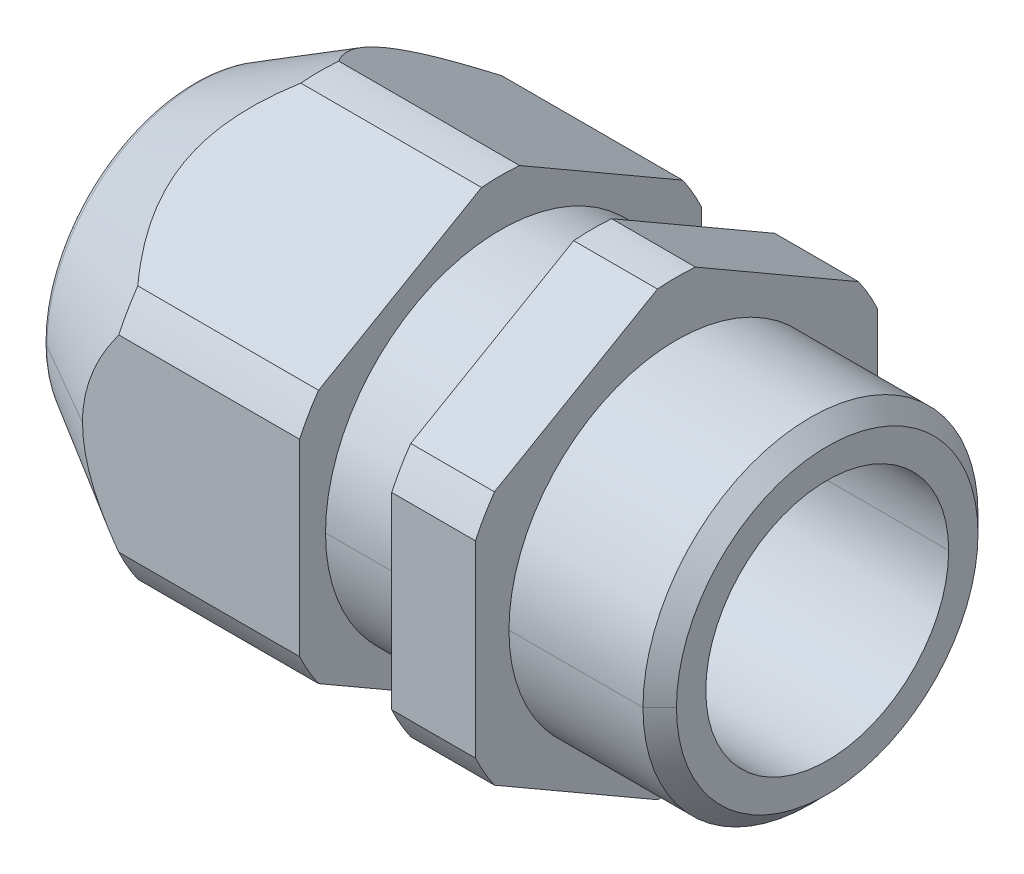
ISO-10303-21;
HEADER;
FILE_DESCRIPTION(('STEP AP214'),'2;1');
FILE_NAME('part.step','',(''),(''),'','','');
FILE_SCHEMA(('AUTOMOTIVE_DESIGN { 1 0 10303 214 1 1 1 1 }'));
ENDSEC;
DATA;
#1=APPLICATION_CONTEXT('core data for automotive mechanical design processes');
#2=APPLICATION_PROTOCOL_DEFINITION('international standard','automotive_design',2000,#1);
#3=PRODUCT_CONTEXT('',#1,'mechanical');
#4=PRODUCT('Part','Part','',(#3));
#5=PRODUCT_RELATED_PRODUCT_CATEGORY('part','',(#4));
#6=PRODUCT_DEFINITION_FORMATION('','',#4);
#7=PRODUCT_DEFINITION_CONTEXT('part definition',#1,'design');
#8=PRODUCT_DEFINITION('design','',#6,#7);
#9=PRODUCT_DEFINITION_SHAPE('','',#8);
#10=(LENGTH_UNIT() NAMED_UNIT(*) SI_UNIT(.MILLI.,.METRE.));
#11=(NAMED_UNIT(*) PLANE_ANGLE_UNIT() SI_UNIT($,.RADIAN.));
#12=(NAMED_UNIT(*) SI_UNIT($,.STERADIAN.) SOLID_ANGLE_UNIT());
#13=UNCERTAINTY_MEASURE_WITH_UNIT(LENGTH_MEASURE(1.E-05),#10,'distance_accuracy_value','');
#14=(GEOMETRIC_REPRESENTATION_CONTEXT(3) GLOBAL_UNCERTAINTY_ASSIGNED_CONTEXT((#13)) GLOBAL_UNIT_ASSIGNED_CONTEXT((#10,
#11,#12)) REPRESENTATION_CONTEXT('',''));
#15=CARTESIAN_POINT('',(0.,0.,0.));
#16=DIRECTION('',(0.,0.,1.));
#17=DIRECTION('',(1.,0.,0.));
#18=AXIS2_PLACEMENT_3D('',#15,#16,#17);
#19=CARTESIAN_POINT('',(-5.,6.9282032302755,12.));
#20=DIRECTION('',(0.,0.,1.));
#21=DIRECTION('',(1.,0.,0.));
#22=AXIS2_PLACEMENT_3D('',#19,#20,#21);
#23=PLANE('',#22);
#24=DIRECTION('',(0.,-1.,0.));
#25=VECTOR('',#24,1.);
#26=CARTESIAN_POINT('',(0.,6.9282032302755,12.));
#27=LINE('',#26,#25);
#28=CARTESIAN_POINT('',(0.,5.61805126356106,12.));
#29=VERTEX_POINT('',#28);
#30=CARTESIAN_POINT('',(0.,-5.61805126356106,12.));
#31=VERTEX_POINT('',#30);
#32=EDGE_CURVE('E9',#29,#31,#27,.T.);
#33=ORIENTED_EDGE('',*,*,#32,.F.);
#34=DIRECTION('',(-1.,0.,0.));
#35=VECTOR('',#34,1.);
#36=CARTESIAN_POINT('',(-29.5,5.61805126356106,12.));
#37=LINE('',#36,#35);
#38=CARTESIAN_POINT('',(-5.,5.61805126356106,12.));
#39=VERTEX_POINT('',#38);
#40=EDGE_CURVE('E23',#29,#39,#37,.T.);
#41=ORIENTED_EDGE('',*,*,#40,.T.);
#42=DIRECTION('',(0.,-1.,0.));
#43=VECTOR('',#42,1.);
#44=CARTESIAN_POINT('',(-5.,6.9282032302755,12.));
#45=LINE('',#44,#43);
#46=CARTESIAN_POINT('',(-5.,-5.61805126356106,12.));
#47=VERTEX_POINT('',#46);
#48=EDGE_CURVE('E953',#39,#47,#45,.T.);
#49=ORIENTED_EDGE('',*,*,#48,.T.);
#50=DIRECTION('',(1.,0.,0.));
#51=VECTOR('',#50,1.);
#52=CARTESIAN_POINT('',(-29.5,-5.61805126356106,12.));
#53=LINE('',#52,#51);
#54=EDGE_CURVE('E949',#47,#31,#53,.T.);
#55=ORIENTED_EDGE('',*,*,#54,.T.);
#56=EDGE_LOOP('',(#33,#41,#49,#55));
#57=FACE_BOUND('',#56,.T.);
#58=ADVANCED_FACE('F15',(#57),#23,.T.);
#59=CARTESIAN_POINT('',(-29.5,0.,0.));
#60=DIRECTION('',(-1.,0.,0.));
#61=DIRECTION('',(0.,0.500000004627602,-0.866025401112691));
#62=AXIS2_PLACEMENT_3D('',#59,#60,#61);
#63=CYLINDRICAL_SURFACE('',#62,13.25);
#64=CARTESIAN_POINT('',(-5.,0.,0.));
#65=DIRECTION('',(1.,0.,0.));
#66=DIRECTION('',(0.,0.,-1.));
#67=AXIS2_PLACEMENT_3D('',#64,#65,#66);
#68=CIRCLE('',#67,13.25);
#69=CARTESIAN_POINT('',(-5.,-7.58327921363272,10.8653751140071));
#70=VERTEX_POINT('',#69);
#71=EDGE_CURVE('E945',#47,#70,#68,.T.);
#72=ORIENTED_EDGE('',*,*,#71,.T.);
#73=DIRECTION('',(-1.,0.,0.));
#74=VECTOR('',#73,1.);
#75=CARTESIAN_POINT('',(-29.5,-7.58327921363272,10.8653751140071));
#76=LINE('',#75,#74);
#77=CARTESIAN_POINT('',(0.,-7.58327921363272,10.8653751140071));
#78=VERTEX_POINT('',#77);
#79=EDGE_CURVE('E940',#78,#70,#76,.T.);
#80=ORIENTED_EDGE('',*,*,#79,.F.);
#81=CARTESIAN_POINT('',(0.,0.,0.));
#82=DIRECTION('',(1.,0.,0.));
#83=DIRECTION('',(0.,0.,-1.));
#84=AXIS2_PLACEMENT_3D('',#81,#82,#83);
#85=CIRCLE('',#84,13.25);
#86=EDGE_CURVE('E935',#31,#78,#85,.T.);
#87=ORIENTED_EDGE('',*,*,#86,.F.);
#88=ORIENTED_EDGE('',*,*,#54,.F.);
#89=EDGE_LOOP('',(#72,#80,#87,#88));
#90=FACE_BOUND('',#89,.T.);
#91=ADVANCED_FACE('F606',(#90),#63,.T.);
#92=CARTESIAN_POINT('',(0.,0.,0.));
#93=DIRECTION('',(1.,0.,0.));
#94=DIRECTION('',(0.,0.,-1.));
#95=AXIS2_PLACEMENT_3D('',#92,#93,#94);
#96=PLANE('',#95);
#97=CARTESIAN_POINT('',(0.,0.,0.));
#98=DIRECTION('',(1.,0.,0.));
#99=DIRECTION('',(0.,0.,-1.));
#100=AXIS2_PLACEMENT_3D('',#97,#98,#99);
#101=CIRCLE('',#100,10.);
#102=CARTESIAN_POINT('',(0.,0.,10.));
#103=VERTEX_POINT('',#102);
#104=CARTESIAN_POINT('',(0.,0.,-10.));
#105=VERTEX_POINT('',#104);
#106=EDGE_CURVE('E299',#103,#105,#101,.T.);
#107=ORIENTED_EDGE('',*,*,#106,.F.);
#108=CARTESIAN_POINT('',(0.,0.,0.));
#109=DIRECTION('',(1.,0.,0.));
#110=DIRECTION('',(0.,0.,-1.));
#111=AXIS2_PLACEMENT_3D('',#108,#109,#110);
#112=CIRCLE('',#111,10.);
#113=EDGE_CURVE('E928',#105,#103,#112,.T.);
#114=ORIENTED_EDGE('',*,*,#113,.F.);
#115=EDGE_LOOP('',(#107,#114));
#116=FACE_BOUND('',#115,.T.);
#117=DIRECTION('',(0.,1.,0.));
#118=VECTOR('',#117,1.);
#119=CARTESIAN_POINT('',(0.,-6.9282032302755,-12.));
#120=LINE('',#119,#118);
#121=CARTESIAN_POINT('',(0.,-5.61805126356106,-12.));
#122=VERTEX_POINT('',#121);
#123=CARTESIAN_POINT('',(0.,5.61805126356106,-12.));
#124=VERTEX_POINT('',#123);
#125=EDGE_CURVE('E924',#122,#124,#120,.T.);
#126=ORIENTED_EDGE('',*,*,#125,.T.);
#127=CARTESIAN_POINT('',(0.,0.,0.));
#128=DIRECTION('',(1.,0.,0.));
#129=DIRECTION('',(0.,0.,-1.));
#130=AXIS2_PLACEMENT_3D('',#127,#128,#129);
#131=CIRCLE('',#130,13.25);
#132=CARTESIAN_POINT('',(0.,7.58327921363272,-10.8653751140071));
#133=VERTEX_POINT('',#132);
#134=EDGE_CURVE('E920',#124,#133,#131,.T.);
#135=ORIENTED_EDGE('',*,*,#134,.T.);
#136=DIRECTION('',(0.,0.5,0.866025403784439));
#137=VECTOR('',#136,1.);
#138=CARTESIAN_POINT('',(0.,6.9282032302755,-12.));
#139=LINE('',#138,#137);
#140=CARTESIAN_POINT('',(0.,13.2013304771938,-1.13462488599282));
#141=VERTEX_POINT('',#140);
#142=EDGE_CURVE('E916',#133,#141,#139,.T.);
#143=ORIENTED_EDGE('',*,*,#142,.T.);
#144=CARTESIAN_POINT('',(0.,0.,0.));
#145=DIRECTION('',(1.,0.,0.));
#146=DIRECTION('',(0.,0.,-1.));
#147=AXIS2_PLACEMENT_3D('',#144,#145,#146);
#148=CIRCLE('',#147,13.25);
#149=CARTESIAN_POINT('',(0.,13.2013304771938,1.13462488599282));
#150=VERTEX_POINT('',#149);
#151=EDGE_CURVE('E912',#141,#150,#148,.T.);
#152=ORIENTED_EDGE('',*,*,#151,.T.);
#153=DIRECTION('',(0.,-0.5,0.866025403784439));
#154=VECTOR('',#153,1.);
#155=CARTESIAN_POINT('',(0.,13.856406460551,0.));
#156=LINE('',#155,#154);
#157=CARTESIAN_POINT('',(0.,7.58327921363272,10.8653751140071));
#158=VERTEX_POINT('',#157);
#159=EDGE_CURVE('E908',#150,#158,#156,.T.);
#160=ORIENTED_EDGE('',*,*,#159,.T.);
#161=CARTESIAN_POINT('',(0.,0.,0.));
#162=DIRECTION('',(1.,0.,0.));
#163=DIRECTION('',(0.,0.,-1.));
#164=AXIS2_PLACEMENT_3D('',#161,#162,#163);
#165=CIRCLE('',#164,13.25);
#166=EDGE_CURVE('E904',#158,#29,#165,.T.);
#167=ORIENTED_EDGE('',*,*,#166,.T.);
#168=ORIENTED_EDGE('',*,*,#32,.T.);
#169=ORIENTED_EDGE('',*,*,#86,.T.);
#170=DIRECTION('',(0.,-0.5,-0.866025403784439));
#171=VECTOR('',#170,1.);
#172=CARTESIAN_POINT('',(0.,-6.9282032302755,12.));
#173=LINE('',#172,#171);
#174=CARTESIAN_POINT('',(0.,-13.2013304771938,1.13462488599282));
#175=VERTEX_POINT('',#174);
#176=EDGE_CURVE('E900',#78,#175,#173,.T.);
#177=ORIENTED_EDGE('',*,*,#176,.T.);
#178=CARTESIAN_POINT('',(0.,0.,0.));
#179=DIRECTION('',(1.,0.,0.));
#180=DIRECTION('',(0.,0.,-1.));
#181=AXIS2_PLACEMENT_3D('',#178,#179,#180);
#182=CIRCLE('',#181,13.25);
#183=CARTESIAN_POINT('',(0.,-13.2013304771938,-1.13462488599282));
#184=VERTEX_POINT('',#183);
#185=EDGE_CURVE('E896',#175,#184,#182,.T.);
#186=ORIENTED_EDGE('',*,*,#185,.T.);
#187=DIRECTION('',(0.,0.5,-0.866025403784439));
#188=VECTOR('',#187,1.);
#189=CARTESIAN_POINT('',(0.,-13.856406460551,0.));
#190=LINE('',#189,#188);
#191=CARTESIAN_POINT('',(0.,-7.58327921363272,-10.8653751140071));
#192=VERTEX_POINT('',#191);
#193=EDGE_CURVE('E892',#184,#192,#190,.T.);
#194=ORIENTED_EDGE('',*,*,#193,.T.);
#195=CARTESIAN_POINT('',(0.,0.,0.));
#196=DIRECTION('',(1.,0.,0.));
#197=DIRECTION('',(0.,0.,-1.));
#198=AXIS2_PLACEMENT_3D('',#195,#196,#197);
#199=CIRCLE('',#198,13.25);
#200=EDGE_CURVE('E888',#192,#122,#199,.T.);
#201=ORIENTED_EDGE('',*,*,#200,.T.);
#202=EDGE_LOOP('',(#126,#135,#143,#152,#160,#167,#168,#169,#177,#186,#194,#201));
#203=FACE_BOUND('',#202,.T.);
#204=ADVANCED_FACE('F610',(#116,#203),#96,.T.);
#205=CARTESIAN_POINT('',(-29.5,0.,0.));
#206=DIRECTION('',(-1.,0.,0.));
#207=DIRECTION('',(0.,0.500000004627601,0.866025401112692));
#208=AXIS2_PLACEMENT_3D('',#205,#206,#207);
#209=CYLINDRICAL_SURFACE('',#208,13.25);
#210=CARTESIAN_POINT('',(-5.,0.,0.));
#211=DIRECTION('',(1.,0.,0.));
#212=DIRECTION('',(0.,0.,-1.));
#213=AXIS2_PLACEMENT_3D('',#210,#211,#212);
#214=CIRCLE('',#213,13.25);
#215=CARTESIAN_POINT('',(-5.,-7.58327921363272,-10.8653751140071));
#216=VERTEX_POINT('',#215);
#217=CARTESIAN_POINT('',(-5.,-5.61805126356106,-12.));
#218=VERTEX_POINT('',#217);
#219=EDGE_CURVE('E884',#216,#218,#214,.T.);
#220=ORIENTED_EDGE('',*,*,#219,.T.);
#221=DIRECTION('',(-1.,0.,0.));
#222=VECTOR('',#221,1.);
#223=CARTESIAN_POINT('',(-29.5,-5.61805126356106,-12.));
#224=LINE('',#223,#222);
#225=EDGE_CURVE('E879',#122,#218,#224,.T.);
#226=ORIENTED_EDGE('',*,*,#225,.F.);
#227=ORIENTED_EDGE('',*,*,#200,.F.);
#228=DIRECTION('',(1.,0.,0.));
#229=VECTOR('',#228,1.);
#230=CARTESIAN_POINT('',(-29.5,-7.58327921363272,-10.8653751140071));
#231=LINE('',#230,#229);
#232=EDGE_CURVE('E874',#216,#192,#231,.T.);
#233=ORIENTED_EDGE('',*,*,#232,.F.);
#234=EDGE_LOOP('',(#220,#226,#227,#233));
#235=FACE_BOUND('',#234,.T.);
#236=ADVANCED_FACE('F615',(#235),#209,.T.);
#237=CARTESIAN_POINT('',(-5.,-13.856406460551,0.));
#238=DIRECTION('',(0.,-0.866025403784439,-0.5));
#239=DIRECTION('',(0.,0.5,-0.866025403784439));
#240=AXIS2_PLACEMENT_3D('',#237,#238,#239);
#241=PLANE('',#240);
#242=ORIENTED_EDGE('',*,*,#193,.F.);
#243=DIRECTION('',(-1.,0.,0.));
#244=VECTOR('',#243,1.);
#245=CARTESIAN_POINT('',(-29.5,-13.2013304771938,-1.13462488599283));
#246=LINE('',#245,#244);
#247=CARTESIAN_POINT('',(-5.,-13.2013304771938,-1.13462488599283));
#248=VERTEX_POINT('',#247);
#249=EDGE_CURVE('E870',#184,#248,#246,.T.);
#250=ORIENTED_EDGE('',*,*,#249,.T.);
#251=DIRECTION('',(0.,0.5,-0.866025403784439));
#252=VECTOR('',#251,1.);
#253=CARTESIAN_POINT('',(-5.,-13.856406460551,0.));
#254=LINE('',#253,#252);
#255=EDGE_CURVE('E865',#248,#216,#254,.T.);
#256=ORIENTED_EDGE('',*,*,#255,.T.);
#257=ORIENTED_EDGE('',*,*,#232,.T.);
#258=EDGE_LOOP('',(#242,#250,#256,#257));
#259=FACE_BOUND('',#258,.T.);
#260=ADVANCED_FACE('F621',(#259),#241,.T.);
#261=CARTESIAN_POINT('',(-5.,0.,0.));
#262=DIRECTION('',(1.,0.,0.));
#263=DIRECTION('',(0.,0.,-1.));
#264=AXIS2_PLACEMENT_3D('',#261,#262,#263);
#265=PLANE('',#264);
#266=CARTESIAN_POINT('',(-5.,0.,0.));
#267=DIRECTION('',(-1.,0.,0.));
#268=DIRECTION('',(0.,0.,-1.));
#269=AXIS2_PLACEMENT_3D('',#266,#267,#268);
#270=CIRCLE('',#269,10.45);
#271=CARTESIAN_POINT('',(-5.,0.,10.45));
#272=VERTEX_POINT('',#271);
#273=CARTESIAN_POINT('',(-5.,0.,-10.45));
#274=VERTEX_POINT('',#273);
#275=EDGE_CURVE('E860',#272,#274,#270,.T.);
#276=ORIENTED_EDGE('',*,*,#275,.F.);
#277=CARTESIAN_POINT('',(-5.,0.,0.));
#278=DIRECTION('',(-1.,0.,0.));
#279=DIRECTION('',(0.,0.,-1.));
#280=AXIS2_PLACEMENT_3D('',#277,#278,#279);
#281=CIRCLE('',#280,10.45);
#282=EDGE_CURVE('E855',#274,#272,#281,.T.);
#283=ORIENTED_EDGE('',*,*,#282,.F.);
#284=EDGE_LOOP('',(#276,#283));
#285=FACE_BOUND('',#284,.T.);
#286=CARTESIAN_POINT('',(-5.,0.,0.));
#287=DIRECTION('',(1.,0.,0.));
#288=DIRECTION('',(0.,0.,-1.));
#289=AXIS2_PLACEMENT_3D('',#286,#287,#288);
#290=CIRCLE('',#289,13.25);
#291=CARTESIAN_POINT('',(-5.,5.61805126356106,-12.));
#292=VERTEX_POINT('',#291);
#293=CARTESIAN_POINT('',(-5.,7.58327921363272,-10.8653751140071));
#294=VERTEX_POINT('',#293);
#295=EDGE_CURVE('E850',#292,#294,#290,.T.);
#296=ORIENTED_EDGE('',*,*,#295,.F.);
#297=DIRECTION('',(0.,1.,0.));
#298=VECTOR('',#297,1.);
#299=CARTESIAN_POINT('',(-5.,-6.9282032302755,-12.));
#300=LINE('',#299,#298);
#301=EDGE_CURVE('E845',#218,#292,#300,.T.);
#302=ORIENTED_EDGE('',*,*,#301,.F.);
#303=ORIENTED_EDGE('',*,*,#219,.F.);
#304=ORIENTED_EDGE('',*,*,#255,.F.);
#305=CARTESIAN_POINT('',(-5.,0.,0.));
#306=DIRECTION('',(1.,0.,0.));
#307=DIRECTION('',(0.,0.,-1.));
#308=AXIS2_PLACEMENT_3D('',#305,#306,#307);
#309=CIRCLE('',#308,13.25);
#310=CARTESIAN_POINT('',(-5.,-13.2013304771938,1.13462488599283));
#311=VERTEX_POINT('',#310);
#312=EDGE_CURVE('E840',#311,#248,#309,.T.);
#313=ORIENTED_EDGE('',*,*,#312,.F.);
#314=DIRECTION('',(0.,-0.5,-0.866025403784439));
#315=VECTOR('',#314,1.);
#316=CARTESIAN_POINT('',(-5.,-6.9282032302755,12.));
#317=LINE('',#316,#315);
#318=EDGE_CURVE('E835',#70,#311,#317,.T.);
#319=ORIENTED_EDGE('',*,*,#318,.F.);
#320=ORIENTED_EDGE('',*,*,#71,.F.);
#321=ORIENTED_EDGE('',*,*,#48,.F.);
#322=CARTESIAN_POINT('',(-5.,0.,0.));
#323=DIRECTION('',(1.,0.,0.));
#324=DIRECTION('',(0.,0.,-1.));
#325=AXIS2_PLACEMENT_3D('',#322,#323,#324);
#326=CIRCLE('',#325,13.25);
#327=CARTESIAN_POINT('',(-5.,7.58327921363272,10.8653751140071));
#328=VERTEX_POINT('',#327);
#329=EDGE_CURVE('E831',#328,#39,#326,.T.);
#330=ORIENTED_EDGE('',*,*,#329,.F.);
#331=DIRECTION('',(0.,-0.5,0.866025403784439));
#332=VECTOR('',#331,1.);
#333=CARTESIAN_POINT('',(-5.,13.856406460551,0.));
#334=LINE('',#333,#332);
#335=CARTESIAN_POINT('',(-5.,13.2013304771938,1.13462488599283));
#336=VERTEX_POINT('',#335);
#337=EDGE_CURVE('E826',#336,#328,#334,.T.);
#338=ORIENTED_EDGE('',*,*,#337,.F.);
#339=CARTESIAN_POINT('',(-5.,0.,0.));
#340=DIRECTION('',(1.,0.,0.));
#341=DIRECTION('',(0.,0.,-1.));
#342=AXIS2_PLACEMENT_3D('',#339,#340,#341);
#343=CIRCLE('',#342,13.25);
#344=CARTESIAN_POINT('',(-5.,13.2013304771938,-1.13462488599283));
#345=VERTEX_POINT('',#344);
#346=EDGE_CURVE('E821',#345,#336,#343,.T.);
#347=ORIENTED_EDGE('',*,*,#346,.F.);
#348=DIRECTION('',(0.,0.5,0.866025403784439));
#349=VECTOR('',#348,1.);
#350=CARTESIAN_POINT('',(-5.,6.9282032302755,-12.));
#351=LINE('',#350,#349);
#352=EDGE_CURVE('E816',#294,#345,#351,.T.);
#353=ORIENTED_EDGE('',*,*,#352,.F.);
#354=EDGE_LOOP('',(#296,#302,#303,#304,#313,#319,#320,#321,#330,#338,#347,#353));
#355=FACE_BOUND('',#354,.T.);
#356=ADVANCED_FACE('F625',(#285,#355),#265,.F.);
#357=CARTESIAN_POINT('',(-5.,6.9282032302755,-12.));
#358=DIRECTION('',(0.,0.866025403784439,-0.5));
#359=DIRECTION('',(0.,0.5,0.866025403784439));
#360=AXIS2_PLACEMENT_3D('',#357,#358,#359);
#361=PLANE('',#360);
#362=ORIENTED_EDGE('',*,*,#142,.F.);
#363=DIRECTION('',(-1.,0.,0.));
#364=VECTOR('',#363,1.);
#365=CARTESIAN_POINT('',(-29.5,7.58327921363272,-10.8653751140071));
#366=LINE('',#365,#364);
#367=EDGE_CURVE('E811',#133,#294,#366,.T.);
#368=ORIENTED_EDGE('',*,*,#367,.T.);
#369=ORIENTED_EDGE('',*,*,#352,.T.);
#370=DIRECTION('',(1.,0.,0.));
#371=VECTOR('',#370,1.);
#372=CARTESIAN_POINT('',(-29.5,13.2013304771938,-1.13462488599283));
#373=LINE('',#372,#371);
#374=EDGE_CURVE('E806',#345,#141,#373,.T.);
#375=ORIENTED_EDGE('',*,*,#374,.T.);
#376=EDGE_LOOP('',(#362,#368,#369,#375));
#377=FACE_BOUND('',#376,.T.);
#378=ADVANCED_FACE('F629',(#377),#361,.T.);
#379=CARTESIAN_POINT('',(-29.5,0.,0.));
#380=DIRECTION('',(-1.,0.,0.));
#381=DIRECTION('',(0.,-1.,0.));
#382=AXIS2_PLACEMENT_3D('',#379,#380,#381);
#383=CYLINDRICAL_SURFACE('',#382,13.25);
#384=ORIENTED_EDGE('',*,*,#346,.T.);
#385=DIRECTION('',(-1.,0.,0.));
#386=VECTOR('',#385,1.);
#387=CARTESIAN_POINT('',(-29.5,13.2013304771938,1.13462488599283));
#388=LINE('',#387,#386);
#389=EDGE_CURVE('E801',#150,#336,#388,.T.);
#390=ORIENTED_EDGE('',*,*,#389,.F.);
#391=ORIENTED_EDGE('',*,*,#151,.F.);
#392=ORIENTED_EDGE('',*,*,#374,.F.);
#393=EDGE_LOOP('',(#384,#390,#391,#392));
#394=FACE_BOUND('',#393,.T.);
#395=ADVANCED_FACE('F633',(#394),#383,.T.);
#396=CARTESIAN_POINT('',(-5.,13.856406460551,0.));
#397=DIRECTION('',(0.,0.866025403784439,0.5));
#398=DIRECTION('',(0.,-0.5,0.866025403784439));
#399=AXIS2_PLACEMENT_3D('',#396,#397,#398);
#400=PLANE('',#399);
#401=ORIENTED_EDGE('',*,*,#159,.F.);
#402=ORIENTED_EDGE('',*,*,#389,.T.);
#403=ORIENTED_EDGE('',*,*,#337,.T.);
#404=DIRECTION('',(1.,0.,0.));
#405=VECTOR('',#404,1.);
#406=CARTESIAN_POINT('',(-29.5,7.58327921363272,10.8653751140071));
#407=LINE('',#406,#405);
#408=EDGE_CURVE('E796',#328,#158,#407,.T.);
#409=ORIENTED_EDGE('',*,*,#408,.T.);
#410=EDGE_LOOP('',(#401,#402,#403,#409));
#411=FACE_BOUND('',#410,.T.);
#412=ADVANCED_FACE('F637',(#411),#400,.T.);
#413=CARTESIAN_POINT('',(-29.5,0.,0.));
#414=DIRECTION('',(-1.,0.,0.));
#415=DIRECTION('',(0.,-0.500000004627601,-0.866025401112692));
#416=AXIS2_PLACEMENT_3D('',#413,#414,#415);
#417=CYLINDRICAL_SURFACE('',#416,13.25);
#418=ORIENTED_EDGE('',*,*,#329,.T.);
#419=ORIENTED_EDGE('',*,*,#40,.F.);
#420=ORIENTED_EDGE('',*,*,#166,.F.);
#421=ORIENTED_EDGE('',*,*,#408,.F.);
#422=EDGE_LOOP('',(#418,#419,#420,#421));
#423=FACE_BOUND('',#422,.T.);
#424=ADVANCED_FACE('F641',(#423),#417,.T.);
#425=CARTESIAN_POINT('',(-29.5,0.,0.));
#426=DIRECTION('',(-1.,0.,0.));
#427=DIRECTION('',(0.,-0.500000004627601,0.866025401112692));
#428=AXIS2_PLACEMENT_3D('',#425,#426,#427);
#429=CYLINDRICAL_SURFACE('',#428,13.25);
#430=ORIENTED_EDGE('',*,*,#295,.T.);
#431=ORIENTED_EDGE('',*,*,#367,.F.);
#432=ORIENTED_EDGE('',*,*,#134,.F.);
#433=DIRECTION('',(1.,0.,0.));
#434=VECTOR('',#433,1.);
#435=CARTESIAN_POINT('',(-29.5,5.61805126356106,-12.));
#436=LINE('',#435,#434);
#437=EDGE_CURVE('E791',#292,#124,#436,.T.);
#438=ORIENTED_EDGE('',*,*,#437,.F.);
#439=EDGE_LOOP('',(#430,#431,#432,#438));
#440=FACE_BOUND('',#439,.T.);
#441=ADVANCED_FACE('F645',(#440),#429,.T.);
#442=CARTESIAN_POINT('',(-5.,-6.9282032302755,-12.));
#443=DIRECTION('',(0.,0.,-1.));
#444=DIRECTION('',(-1.,0.,0.));
#445=AXIS2_PLACEMENT_3D('',#442,#443,#444);
#446=PLANE('',#445);
#447=ORIENTED_EDGE('',*,*,#125,.F.);
#448=ORIENTED_EDGE('',*,*,#225,.T.);
#449=ORIENTED_EDGE('',*,*,#301,.T.);
#450=ORIENTED_EDGE('',*,*,#437,.T.);
#451=EDGE_LOOP('',(#447,#448,#449,#450));
#452=FACE_BOUND('',#451,.T.);
#453=ADVANCED_FACE('F649',(#452),#446,.T.);
#454=CARTESIAN_POINT('',(-5.,-6.9282032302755,12.));
#455=DIRECTION('',(0.,-0.866025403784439,0.5));
#456=DIRECTION('',(0.,-0.5,-0.866025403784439));
#457=AXIS2_PLACEMENT_3D('',#454,#455,#456);
#458=PLANE('',#457);
#459=ORIENTED_EDGE('',*,*,#176,.F.);
#460=ORIENTED_EDGE('',*,*,#79,.T.);
#461=ORIENTED_EDGE('',*,*,#318,.T.);
#462=DIRECTION('',(1.,0.,0.));
#463=VECTOR('',#462,1.);
#464=CARTESIAN_POINT('',(-29.5,-13.2013304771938,1.13462488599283));
#465=LINE('',#464,#463);
#466=EDGE_CURVE('E786',#311,#175,#465,.T.);
#467=ORIENTED_EDGE('',*,*,#466,.T.);
#468=EDGE_LOOP('',(#459,#460,#461,#467));
#469=FACE_BOUND('',#468,.T.);
#470=ADVANCED_FACE('F653',(#469),#458,.T.);
#471=CARTESIAN_POINT('',(-29.5,0.,0.));
#472=DIRECTION('',(-1.,0.,0.));
#473=DIRECTION('',(0.,1.,0.));
#474=AXIS2_PLACEMENT_3D('',#471,#472,#473);
#475=CYLINDRICAL_SURFACE('',#474,13.25);
#476=ORIENTED_EDGE('',*,*,#312,.T.);
#477=ORIENTED_EDGE('',*,*,#249,.F.);
#478=ORIENTED_EDGE('',*,*,#185,.F.);
#479=ORIENTED_EDGE('',*,*,#466,.F.);
#480=EDGE_LOOP('',(#476,#477,#478,#479));
#481=FACE_BOUND('',#480,.T.);
#482=ADVANCED_FACE('F657',(#481),#475,.T.);
#483=CARTESIAN_POINT('',(-5.,0.,0.));
#484=DIRECTION('',(1.,0.,0.));
#485=DIRECTION('',(0.,1.,0.));
#486=AXIS2_PLACEMENT_3D('',#483,#484,#485);
#487=CYLINDRICAL_SURFACE('',#486,10.45);
#488=DIRECTION('',(1.,0.,0.));
#489=VECTOR('',#488,1.);
#490=CARTESIAN_POINT('',(-10.5,0.,10.45));
#491=LINE('',#490,#489);
#492=CARTESIAN_POINT('',(-10.5,0.,10.45));
#493=VERTEX_POINT('',#492);
#494=EDGE_CURVE('E781',#493,#272,#491,.T.);
#495=ORIENTED_EDGE('',*,*,#494,.F.);
#496=CARTESIAN_POINT('',(-10.5,0.,0.));
#497=DIRECTION('',(1.,0.,0.));
#498=DIRECTION('',(0.,0.,-1.));
#499=AXIS2_PLACEMENT_3D('',#496,#497,#498);
#500=CIRCLE('',#499,10.45);
#501=CARTESIAN_POINT('',(-10.5,0.,-10.45));
#502=VERTEX_POINT('',#501);
#503=EDGE_CURVE('E777',#493,#502,#500,.T.);
#504=ORIENTED_EDGE('',*,*,#503,.T.);
#505=DIRECTION('',(1.,0.,0.));
#506=VECTOR('',#505,1.);
#507=CARTESIAN_POINT('',(-10.5,0.,-10.45));
#508=LINE('',#507,#506);
#509=EDGE_CURVE('E772',#502,#274,#508,.T.);
#510=ORIENTED_EDGE('',*,*,#509,.T.);
#511=ORIENTED_EDGE('',*,*,#282,.T.);
#512=EDGE_LOOP('',(#495,#504,#510,#511));
#513=FACE_BOUND('',#512,.T.);
#514=ADVANCED_FACE('F661',(#513),#487,.T.);
#515=CARTESIAN_POINT('',(-5.,0.,0.));
#516=DIRECTION('',(1.,0.,0.));
#517=DIRECTION('',(0.,-1.,0.));
#518=AXIS2_PLACEMENT_3D('',#515,#516,#517);
#519=CYLINDRICAL_SURFACE('',#518,10.45);
#520=ORIENTED_EDGE('',*,*,#494,.T.);
#521=ORIENTED_EDGE('',*,*,#275,.T.);
#522=ORIENTED_EDGE('',*,*,#509,.F.);
#523=CARTESIAN_POINT('',(-10.5,0.,0.));
#524=DIRECTION('',(1.,0.,0.));
#525=DIRECTION('',(0.,0.,-1.));
#526=AXIS2_PLACEMENT_3D('',#523,#524,#525);
#527=CIRCLE('',#526,10.45);
#528=EDGE_CURVE('E767',#502,#493,#527,.T.);
#529=ORIENTED_EDGE('',*,*,#528,.T.);
#530=EDGE_LOOP('',(#520,#521,#522,#529));
#531=FACE_BOUND('',#530,.T.);
#532=ADVANCED_FACE('F665',(#531),#519,.T.);
#533=CARTESIAN_POINT('',(-10.5,0.,0.));
#534=DIRECTION('',(1.,0.,0.));
#535=DIRECTION('',(0.,0.,-1.));
#536=AXIS2_PLACEMENT_3D('',#533,#534,#535);
#537=PLANE('',#536);
#538=ORIENTED_EDGE('',*,*,#503,.F.);
#539=ORIENTED_EDGE('',*,*,#528,.F.);
#540=EDGE_LOOP('',(#538,#539));
#541=FACE_BOUND('',#540,.T.);
#542=DIRECTION('',(0.,1.,0.));
#543=VECTOR('',#542,1.);
#544=CARTESIAN_POINT('',(-10.5,-6.9282032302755,-12.));
#545=LINE('',#544,#543);
#546=CARTESIAN_POINT('',(-10.5,-5.61805126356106,-12.));
#547=VERTEX_POINT('',#546);
#548=CARTESIAN_POINT('',(-10.5,5.61805126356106,-12.));
#549=VERTEX_POINT('',#548);
#550=EDGE_CURVE('E763',#547,#549,#545,.T.);
#551=ORIENTED_EDGE('',*,*,#550,.T.);
#552=CARTESIAN_POINT('',(-10.5,0.,0.));
#553=DIRECTION('',(1.,0.,0.));
#554=DIRECTION('',(0.,0.,-1.));
#555=AXIS2_PLACEMENT_3D('',#552,#553,#554);
#556=CIRCLE('',#555,13.25);
#557=CARTESIAN_POINT('',(-10.5,7.58327921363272,-10.8653751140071));
#558=VERTEX_POINT('',#557);
#559=EDGE_CURVE('E759',#549,#558,#556,.T.);
#560=ORIENTED_EDGE('',*,*,#559,.T.);
#561=DIRECTION('',(0.,0.5,0.866025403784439));
#562=VECTOR('',#561,1.);
#563=CARTESIAN_POINT('',(-10.5,6.9282032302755,-12.));
#564=LINE('',#563,#562);
#565=CARTESIAN_POINT('',(-10.5,13.2013304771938,-1.13462488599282));
#566=VERTEX_POINT('',#565);
#567=EDGE_CURVE('E755',#558,#566,#564,.T.);
#568=ORIENTED_EDGE('',*,*,#567,.T.);
#569=CARTESIAN_POINT('',(-10.5,0.,0.));
#570=DIRECTION('',(1.,0.,0.));
#571=DIRECTION('',(0.,0.,-1.));
#572=AXIS2_PLACEMENT_3D('',#569,#570,#571);
#573=CIRCLE('',#572,13.25);
#574=CARTESIAN_POINT('',(-10.5,13.2013304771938,1.13462488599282));
#575=VERTEX_POINT('',#574);
#576=EDGE_CURVE('E751',#566,#575,#573,.T.);
#577=ORIENTED_EDGE('',*,*,#576,.T.);
#578=DIRECTION('',(0.,-0.5,0.866025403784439));
#579=VECTOR('',#578,1.);
#580=CARTESIAN_POINT('',(-10.5,13.856406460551,0.));
#581=LINE('',#580,#579);
#582=CARTESIAN_POINT('',(-10.5,7.58327921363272,10.8653751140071));
#583=VERTEX_POINT('',#582);
#584=EDGE_CURVE('E747',#575,#583,#581,.T.);
#585=ORIENTED_EDGE('',*,*,#584,.T.);
#586=CARTESIAN_POINT('',(-10.5,0.,0.));
#587=DIRECTION('',(1.,0.,0.));
#588=DIRECTION('',(0.,0.,-1.));
#589=AXIS2_PLACEMENT_3D('',#586,#587,#588);
#590=CIRCLE('',#589,13.25);
#591=CARTESIAN_POINT('',(-10.5,5.61805126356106,12.));
#592=VERTEX_POINT('',#591);
#593=EDGE_CURVE('E743',#583,#592,#590,.T.);
#594=ORIENTED_EDGE('',*,*,#593,.T.);
#595=DIRECTION('',(0.,-1.,0.));
#596=VECTOR('',#595,1.);
#597=CARTESIAN_POINT('',(-10.5,6.9282032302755,12.));
#598=LINE('',#597,#596);
#599=CARTESIAN_POINT('',(-10.5,-5.61805126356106,12.));
#600=VERTEX_POINT('',#599);
#601=EDGE_CURVE('E739',#592,#600,#598,.T.);
#602=ORIENTED_EDGE('',*,*,#601,.T.);
#603=CARTESIAN_POINT('',(-10.5,0.,0.));
#604=DIRECTION('',(1.,0.,0.));
#605=DIRECTION('',(0.,0.,-1.));
#606=AXIS2_PLACEMENT_3D('',#603,#604,#605);
#607=CIRCLE('',#606,13.25);
#608=CARTESIAN_POINT('',(-10.5,-7.58327921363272,10.8653751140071));
#609=VERTEX_POINT('',#608);
#610=EDGE_CURVE('E735',#600,#609,#607,.T.);
#611=ORIENTED_EDGE('',*,*,#610,.T.);
#612=DIRECTION('',(0.,-0.5,-0.866025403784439));
#613=VECTOR('',#612,1.);
#614=CARTESIAN_POINT('',(-10.5,-6.9282032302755,12.));
#615=LINE('',#614,#613);
#616=CARTESIAN_POINT('',(-10.5,-13.2013304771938,1.13462488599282));
#617=VERTEX_POINT('',#616);
#618=EDGE_CURVE('E731',#609,#617,#615,.T.);
#619=ORIENTED_EDGE('',*,*,#618,.T.);
#620=CARTESIAN_POINT('',(-10.5,0.,0.));
#621=DIRECTION('',(1.,0.,0.));
#622=DIRECTION('',(0.,0.,-1.));
#623=AXIS2_PLACEMENT_3D('',#620,#621,#622);
#624=CIRCLE('',#623,13.25);
#625=CARTESIAN_POINT('',(-10.5,-13.2013304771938,-1.13462488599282));
#626=VERTEX_POINT('',#625);
#627=EDGE_CURVE('E727',#617,#626,#624,.T.);
#628=ORIENTED_EDGE('',*,*,#627,.T.);
#629=DIRECTION('',(0.,0.5,-0.866025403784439));
#630=VECTOR('',#629,1.);
#631=CARTESIAN_POINT('',(-10.5,-13.856406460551,0.));
#632=LINE('',#631,#630);
#633=CARTESIAN_POINT('',(-10.5,-7.58327921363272,-10.8653751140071));
#634=VERTEX_POINT('',#633);
#635=EDGE_CURVE('E723',#626,#634,#632,.T.);
#636=ORIENTED_EDGE('',*,*,#635,.T.);
#637=CARTESIAN_POINT('',(-10.5,0.,0.));
#638=DIRECTION('',(1.,0.,0.));
#639=DIRECTION('',(0.,0.,-1.));
#640=AXIS2_PLACEMENT_3D('',#637,#638,#639);
#641=CIRCLE('',#640,13.25);
#642=EDGE_CURVE('E719',#634,#547,#641,.T.);
#643=ORIENTED_EDGE('',*,*,#642,.T.);
#644=EDGE_LOOP('',(#551,#560,#568,#577,#585,#594,#602,#611,#619,#628,#636,#643));
#645=FACE_BOUND('',#644,.T.);
#646=ADVANCED_FACE('F669',(#541,#645),#537,.T.);
#647=CARTESIAN_POINT('',(-29.5,0.,0.));
#648=DIRECTION('',(-1.,0.,0.));
#649=DIRECTION('',(0.,0.500000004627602,0.866025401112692));
#650=AXIS2_PLACEMENT_3D('',#647,#648,#649);
#651=CYLINDRICAL_SURFACE('',#650,13.25);
#652=CARTESIAN_POINT('',(-21.292373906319,0.,0.));
#653=DIRECTION('',(-1.,0.,0.));
#654=DIRECTION('',(0.,0.,1.));
#655=AXIS2_PLACEMENT_3D('',#652,#653,#654);
#656=CIRCLE('',#655,13.25);
#657=CARTESIAN_POINT('',(-21.292373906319,-5.61805126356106,-12.));
#658=VERTEX_POINT('',#657);
#659=CARTESIAN_POINT('',(-21.292373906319,-7.58327921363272,-10.8653751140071));
#660=VERTEX_POINT('',#659);
#661=EDGE_CURVE('E715',#658,#660,#656,.T.);
#662=ORIENTED_EDGE('',*,*,#661,.F.);
#663=DIRECTION('',(-1.,0.,0.));
#664=VECTOR('',#663,1.);
#665=CARTESIAN_POINT('',(-29.5,-5.61805126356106,-12.));
#666=LINE('',#665,#664);
#667=EDGE_CURVE('E710',#547,#658,#666,.T.);
#668=ORIENTED_EDGE('',*,*,#667,.F.);
#669=ORIENTED_EDGE('',*,*,#642,.F.);
#670=DIRECTION('',(1.,0.,0.));
#671=VECTOR('',#670,1.);
#672=CARTESIAN_POINT('',(-29.5,-7.58327921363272,-10.8653751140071));
#673=LINE('',#672,#671);
#674=EDGE_CURVE('E706',#660,#634,#673,.T.);
#675=ORIENTED_EDGE('',*,*,#674,.F.);
#676=EDGE_LOOP('',(#662,#668,#669,#675));
#677=FACE_BOUND('',#676,.T.);
#678=ADVANCED_FACE('F673',(#677),#651,.T.);
#679=CARTESIAN_POINT('',(-29.,-13.856406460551,0.));
#680=DIRECTION('',(0.,-0.866025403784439,-0.5));
#681=DIRECTION('',(0.,0.5,-0.866025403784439));
#682=AXIS2_PLACEMENT_3D('',#679,#680,#681);
#683=PLANE('',#682);
#684=ORIENTED_EDGE('',*,*,#635,.F.);
#685=DIRECTION('',(-1.,0.,0.));
#686=VECTOR('',#685,1.);
#687=CARTESIAN_POINT('',(-29.5,-13.2013304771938,-1.13462488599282));
#688=LINE('',#687,#686);
#689=CARTESIAN_POINT('',(-21.292373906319,-13.2013304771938,-1.13462488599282));
#690=VERTEX_POINT('',#689);
#691=EDGE_CURVE('E704',#626,#690,#688,.T.);
#692=ORIENTED_EDGE('',*,*,#691,.T.);
#693=CARTESIAN_POINT('',(-21.292173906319,-13.2014666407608,-1.13438904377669));
#694=CARTESIAN_POINT('',(-21.6581226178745,-12.9523271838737,-1.56591124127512));
#695=CARTESIAN_POINT('',(-22.0023175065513,-12.6907195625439,-2.01902893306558));
#696=CARTESIAN_POINT('',(-22.6020269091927,-12.1500833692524,-2.95543828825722));
#697=CARTESIAN_POINT('',(-22.8643689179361,-11.8642194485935,-3.45056912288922));
#698=CARTESIAN_POINT('',(-23.1899443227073,-11.3766610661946,-4.29504501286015));
#699=CARTESIAN_POINT('',(-23.2930125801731,-11.1748062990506,-4.64466772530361));
#700=CARTESIAN_POINT('',(-23.4278346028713,-10.7705790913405,-5.34480978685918));
#701=CARTESIAN_POINT('',(-23.4611838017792,-10.5626095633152,-5.7050235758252));
#702=CARTESIAN_POINT('',(-23.4529928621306,-10.1524499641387,-6.41544084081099));
#703=CARTESIAN_POINT('',(-23.4112324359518,-9.94454641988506,-6.77554034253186));
#704=CARTESIAN_POINT('',(-23.2607538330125,-9.54094911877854,-7.47459137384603));
#705=CARTESIAN_POINT('',(-23.1502838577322,-9.3397791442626,-7.82302799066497));
#706=CARTESIAN_POINT('',(-22.8162952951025,-8.86565195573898,-8.64424037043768));
#707=CARTESIAN_POINT('',(-22.558977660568,-8.59237505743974,-9.1175698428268));
#708=CARTESIAN_POINT('',(-21.9759648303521,-8.07390226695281,-10.0155910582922));
#709=CARTESIAN_POINT('',(-21.6442588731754,-7.82284400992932,-10.4504367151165));
#710=CARTESIAN_POINT('',(-21.292173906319,-7.58314305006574,-10.8656109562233));
#711=B_SPLINE_CURVE_WITH_KNOTS('',3,(#693,#694,#695,#696,#697,#698,#699,#700,#701,#702,#703,
#704,#705,#706,#707,#708,#709,#710),.UNSPECIFIED.,.F.,.F.,(4,2,2,2,2,2,2,2,4),(0.,
0.152018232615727,0.304036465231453,0.404806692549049,0.505576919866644,0.606529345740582,
0.707481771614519,0.85374088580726,1.),.UNSPECIFIED.);
#712=EDGE_CURVE('E702',#690,#660,#711,.T.);
#713=ORIENTED_EDGE('',*,*,#712,.T.);
#714=ORIENTED_EDGE('',*,*,#674,.T.);
#715=EDGE_LOOP('',(#684,#692,#713,#714));
#716=FACE_BOUND('',#715,.T.);
#717=ADVANCED_FACE('F677',(#716),#683,.T.);
#718=CARTESIAN_POINT('',(-28.5,0.,0.));
#719=DIRECTION('',(1.,0.,0.));
#720=DIRECTION('',(0.,1.,0.));
#721=AXIS2_PLACEMENT_3D('',#718,#719,#720);
#722=CONICAL_SURFACE('',#721,9.0886751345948,0.52359877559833);
#723=DIRECTION('',(0.866025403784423,0.,0.500000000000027));
#724=VECTOR('',#723,1.);
#725=CARTESIAN_POINT('',(-28.5,0.,9.0886751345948));
#726=LINE('',#725,#724);
#727=CARTESIAN_POINT('',(-28.5,0.,9.0886751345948));
#728=VERTEX_POINT('',#727);
#729=CARTESIAN_POINT('',(-23.4574374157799,0.,12.));
#730=VERTEX_POINT('',#729);
#731=EDGE_CURVE('E1118',#728,#730,#726,.T.);
#732=ORIENTED_EDGE('',*,*,#731,.F.);
#733=CARTESIAN_POINT('',(-28.5,0.,0.));
#734=DIRECTION('',(-1.,0.,0.));
#735=DIRECTION('',(0.,0.,1.));
#736=AXIS2_PLACEMENT_3D('',#733,#734,#735);
#737=CIRCLE('',#736,9.0886751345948);
#738=CARTESIAN_POINT('',(-28.5,-8.64384371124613,2.80855507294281));
#739=VERTEX_POINT('',#738);
#740=EDGE_CURVE('E1113',#739,#728,#737,.T.);
#741=ORIENTED_EDGE('',*,*,#740,.F.);
#742=CARTESIAN_POINT('',(-28.5,0.,0.));
#743=DIRECTION('',(-1.,0.,0.));
#744=DIRECTION('',(0.,0.,1.));
#745=AXIS2_PLACEMENT_3D('',#742,#743,#744);
#746=CIRCLE('',#745,9.0886751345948);
#747=CARTESIAN_POINT('',(-28.5,0.,-9.0886751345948));
#748=VERTEX_POINT('',#747);
#749=EDGE_CURVE('E1083',#748,#739,#746,.T.);
#750=ORIENTED_EDGE('',*,*,#749,.F.);
#751=DIRECTION('',(0.866025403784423,0.,-0.500000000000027));
#752=VECTOR('',#751,1.);
#753=CARTESIAN_POINT('',(-28.5,0.,-9.0886751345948));
#754=LINE('',#753,#752);
#755=CARTESIAN_POINT('',(-23.4574374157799,0.,-12.));
#756=VERTEX_POINT('',#755);
#757=EDGE_CURVE('E1082',#748,#756,#754,.T.);
#758=ORIENTED_EDGE('',*,*,#757,.T.);
#759=CARTESIAN_POINT('',(-21.292373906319,-5.61805126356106,-12.));
#760=CARTESIAN_POINT('',(-21.6636649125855,-5.11247813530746,-12.));
#761=CARTESIAN_POINT('',(-22.0181167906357,-4.57228623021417,-12.));
#762=CARTESIAN_POINT('',(-22.5489593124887,-3.60804486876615,-12.));
#763=CARTESIAN_POINT('',(-22.7553054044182,-3.1747428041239,-12.));
#764=CARTESIAN_POINT('',(-23.0952097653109,-2.29097040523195,-12.));
#765=CARTESIAN_POINT('',(-23.2324445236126,-1.8296403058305,-12.));
#766=CARTESIAN_POINT('',(-23.3999974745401,-0.973734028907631,-12.));
#767=CARTESIAN_POINT('',(-23.4454296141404,-0.570327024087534,-12.));
#768=CARTESIAN_POINT('',(-23.4567248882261,-0.114612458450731,-12.));
#769=CARTESIAN_POINT('',(-23.4574154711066,-0.0573489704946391,-12.));
#770=CARTESIAN_POINT('',(-23.4573881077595,-2.35266901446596E-08,-12.));
#771=B_SPLINE_CURVE_WITH_KNOTS('',3,(#759,#760,#761,#762,#763,#764,#765,#766,#767,#768,#769,
#770),.UNSPECIFIED.,.F.,.F.,(4,2,2,2,2,4),(0.,0.154338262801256,0.270828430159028,
0.3873185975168,0.48542113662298,0.49948141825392),.UNSPECIFIED.);
#772=EDGE_CURVE('E1079',#658,#756,#771,.T.);
#773=ORIENTED_EDGE('',*,*,#772,.F.);
#774=ORIENTED_EDGE('',*,*,#661,.T.);
#775=ORIENTED_EDGE('',*,*,#712,.F.);
#776=CARTESIAN_POINT('',(-21.292373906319,0.,0.));
#777=DIRECTION('',(-1.,0.,0.));
#778=DIRECTION('',(0.,0.,1.));
#779=AXIS2_PLACEMENT_3D('',#776,#777,#778);
#780=CIRCLE('',#779,13.25);
#781=CARTESIAN_POINT('',(-21.292373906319,-13.2013304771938,1.13462488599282));
#782=VERTEX_POINT('',#781);
#783=EDGE_CURVE('E1077',#690,#782,#780,.T.);
#784=ORIENTED_EDGE('',*,*,#783,.T.);
#785=CARTESIAN_POINT('',(-21.292173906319,-7.58314305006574,10.8656109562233));
#786=CARTESIAN_POINT('',(-21.6581226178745,-7.83228250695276,10.4340887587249));
#787=CARTESIAN_POINT('',(-22.0023175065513,-8.09389012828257,9.9809710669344));
#788=CARTESIAN_POINT('',(-22.6020269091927,-8.63452632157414,9.04456171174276));
#789=CARTESIAN_POINT('',(-22.8643689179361,-8.92039024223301,8.54943087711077));
#790=CARTESIAN_POINT('',(-23.1899443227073,-9.40794862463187,7.70495498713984));
#791=CARTESIAN_POINT('',(-23.2930125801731,-9.60980339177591,7.35533227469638));
#792=CARTESIAN_POINT('',(-23.4278346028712,-10.014030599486,6.65519021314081));
#793=CARTESIAN_POINT('',(-23.4611838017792,-10.2220001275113,6.29497642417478));
#794=CARTESIAN_POINT('',(-23.4529928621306,-10.6321597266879,5.58455915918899));
#795=CARTESIAN_POINT('',(-23.4112324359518,-10.8400632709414,5.22445965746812));
#796=CARTESIAN_POINT('',(-23.2607538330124,-11.243660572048,4.52540862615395));
#797=CARTESIAN_POINT('',(-23.1502838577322,-11.4448305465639,4.17697200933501));
#798=CARTESIAN_POINT('',(-22.8162952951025,-11.9189577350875,3.3557596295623));
#799=CARTESIAN_POINT('',(-22.558977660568,-12.1922346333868,2.88243015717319));
#800=CARTESIAN_POINT('',(-21.9759648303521,-12.7107074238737,1.98440894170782));
#801=CARTESIAN_POINT('',(-21.6442588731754,-12.9617656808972,1.54956328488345));
#802=CARTESIAN_POINT('',(-21.292173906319,-13.2014666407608,1.1343890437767));
#803=B_SPLINE_CURVE_WITH_KNOTS('',3,(#785,#786,#787,#788,#789,#790,#791,#792,#793,#794,#795,
#796,#797,#798,#799,#800,#801,#802),.UNSPECIFIED.,.F.,.F.,(4,2,2,2,2,2,2,2,4),(0.,
0.152018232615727,0.304036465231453,0.404806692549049,0.505576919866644,0.606529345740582,
0.70748177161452,0.85374088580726,1.),.UNSPECIFIED.);
#804=CARTESIAN_POINT('',(-21.292373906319,-7.58327921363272,10.8653751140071));
#805=VERTEX_POINT('',#804);
#806=EDGE_CURVE('E1085',#805,#782,#803,.T.);
#807=ORIENTED_EDGE('',*,*,#806,.F.);
#808=CARTESIAN_POINT('',(-21.292373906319,0.,0.));
#809=DIRECTION('',(-1.,0.,0.));
#810=DIRECTION('',(0.,0.,1.));
#811=AXIS2_PLACEMENT_3D('',#808,#809,#810);
#812=CIRCLE('',#811,13.25);
#813=CARTESIAN_POINT('',(-21.292373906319,-5.61805126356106,12.));
#814=VERTEX_POINT('',#813);
#815=EDGE_CURVE('E1063',#805,#814,#812,.T.);
#816=ORIENTED_EDGE('',*,*,#815,.T.);
#817=CARTESIAN_POINT('',(-23.4573881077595,2.35266936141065E-08,12.));
#818=CARTESIAN_POINT('',(-23.4572245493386,-0.342790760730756,12.));
#819=CARTESIAN_POINT('',(-23.4314102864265,-0.688634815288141,12.));
#820=CARTESIAN_POINT('',(-23.2654070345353,-1.81309770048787,12.));
#821=CARTESIAN_POINT('',(-23.0149611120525,-2.58481168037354,12.));
#822=CARTESIAN_POINT('',(-22.3073621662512,-4.12246390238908,12.));
#823=CARTESIAN_POINT('',(-21.8236629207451,-4.89461480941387,12.));
#824=CARTESIAN_POINT('',(-21.292373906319,-5.61805126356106,12.));
#825=B_SPLINE_CURVE_WITH_KNOTS('',3,(#817,#818,#819,#820,#821,#822,#823,#824),.UNSPECIFIED.,.F.,
.F.,(4,2,2,4),(0.499481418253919,0.583523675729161,0.779153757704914,1.),.UNSPECIFIED.);
#826=EDGE_CURVE('E1053',#730,#814,#825,.T.);
#827=ORIENTED_EDGE('',*,*,#826,.F.);
#828=EDGE_LOOP('',(#732,#741,#750,#758,#773,#774,#775,#784,#807,#816,#827));
#829=FACE_BOUND('',#828,.T.);
#830=ADVANCED_FACE('F682',(#829),#722,.T.);
#831=CARTESIAN_POINT('',(-29.,6.9282032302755,12.));
#832=DIRECTION('',(0.,0.,1.));
#833=DIRECTION('',(1.,0.,0.));
#834=AXIS2_PLACEMENT_3D('',#831,#832,#833);
#835=PLANE('',#834);
#836=ORIENTED_EDGE('',*,*,#601,.F.);
#837=DIRECTION('',(-1.,0.,0.));
#838=VECTOR('',#837,1.);
#839=CARTESIAN_POINT('',(-29.5,5.61805126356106,12.));
#840=LINE('',#839,#838);
#841=CARTESIAN_POINT('',(-21.292373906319,5.61805126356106,12.));
#842=VERTEX_POINT('',#841);
#843=EDGE_CURVE('E1042',#592,#842,#840,.T.);
#844=ORIENTED_EDGE('',*,*,#843,.T.);
#845=CARTESIAN_POINT('',(-21.292373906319,5.61805126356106,12.));
#846=CARTESIAN_POINT('',(-21.6636649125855,5.11247813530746,12.));
#847=CARTESIAN_POINT('',(-22.0181167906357,4.57228623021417,12.));
#848=CARTESIAN_POINT('',(-22.5489593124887,3.60804486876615,12.));
#849=CARTESIAN_POINT('',(-22.7553054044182,3.1747428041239,12.));
#850=CARTESIAN_POINT('',(-23.0952097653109,2.29097040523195,12.));
#851=CARTESIAN_POINT('',(-23.2324445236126,1.8296403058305,12.));
#852=CARTESIAN_POINT('',(-23.3999974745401,0.973734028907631,12.));
#853=CARTESIAN_POINT('',(-23.4454296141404,0.570327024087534,12.));
#854=CARTESIAN_POINT('',(-23.4567248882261,0.114612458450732,12.));
#855=CARTESIAN_POINT('',(-23.4574154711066,0.0573489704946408,12.));
#856=CARTESIAN_POINT('',(-23.4573881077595,2.35266936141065E-08,12.));
#857=B_SPLINE_CURVE_WITH_KNOTS('',3,(#845,#846,#847,#848,#849,#850,#851,#852,#853,#854,#855,
#856),.UNSPECIFIED.,.F.,.F.,(4,2,2,2,2,4),(0.,0.154338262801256,0.270828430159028,
0.3873185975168,0.48542113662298,0.499481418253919),.UNSPECIFIED.);
#858=EDGE_CURVE('E1057',#842,#730,#857,.T.);
#859=ORIENTED_EDGE('',*,*,#858,.T.);
#860=ORIENTED_EDGE('',*,*,#826,.T.);
#861=DIRECTION('',(1.,0.,0.));
#862=VECTOR('',#861,1.);
#863=CARTESIAN_POINT('',(-29.5,-5.61805126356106,12.));
#864=LINE('',#863,#862);
#865=EDGE_CURVE('E1050',#814,#600,#864,.T.);
#866=ORIENTED_EDGE('',*,*,#865,.T.);
#867=EDGE_LOOP('',(#836,#844,#859,#860,#866));
#868=FACE_BOUND('',#867,.T.);
#869=ADVANCED_FACE('F1051',(#868),#835,.T.);
#870=CARTESIAN_POINT('',(-29.5,0.,0.));
#871=DIRECTION('',(-1.,0.,0.));
#872=DIRECTION('',(0.,0.500000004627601,-0.866025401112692));
#873=AXIS2_PLACEMENT_3D('',#870,#871,#872);
#874=CYLINDRICAL_SURFACE('',#873,13.25);
#875=ORIENTED_EDGE('',*,*,#815,.F.);
#876=DIRECTION('',(-1.,0.,0.));
#877=VECTOR('',#876,1.);
#878=CARTESIAN_POINT('',(-29.5,-7.58327921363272,10.8653751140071));
#879=LINE('',#878,#877);
#880=EDGE_CURVE('E1058',#609,#805,#879,.T.);
#881=ORIENTED_EDGE('',*,*,#880,.F.);
#882=ORIENTED_EDGE('',*,*,#610,.F.);
#883=ORIENTED_EDGE('',*,*,#865,.F.);
#884=EDGE_LOOP('',(#875,#881,#882,#883));
#885=FACE_BOUND('',#884,.T.);
#886=ADVANCED_FACE('F1060',(#885),#874,.T.);
#887=CARTESIAN_POINT('',(-29.,-6.9282032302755,12.));
#888=DIRECTION('',(0.,-0.866025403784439,0.5));
#889=DIRECTION('',(0.,-0.5,-0.866025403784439));
#890=AXIS2_PLACEMENT_3D('',#887,#888,#889);
#891=PLANE('',#890);
#892=ORIENTED_EDGE('',*,*,#618,.F.);
#893=ORIENTED_EDGE('',*,*,#880,.T.);
#894=ORIENTED_EDGE('',*,*,#806,.T.);
#895=DIRECTION('',(1.,0.,0.));
#896=VECTOR('',#895,1.);
#897=CARTESIAN_POINT('',(-29.5,-13.2013304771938,1.13462488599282));
#898=LINE('',#897,#896);
#899=EDGE_CURVE('E1066',#782,#617,#898,.T.);
#900=ORIENTED_EDGE('',*,*,#899,.T.);
#901=EDGE_LOOP('',(#892,#893,#894,#900));
#902=FACE_BOUND('',#901,.T.);
#903=ADVANCED_FACE('F1069',(#902),#891,.T.);
#904=CARTESIAN_POINT('',(-29.5,0.,0.));
#905=DIRECTION('',(-1.,0.,0.));
#906=DIRECTION('',(0.,1.,0.));
#907=AXIS2_PLACEMENT_3D('',#904,#905,#906);
#908=CYLINDRICAL_SURFACE('',#907,13.25);
#909=ORIENTED_EDGE('',*,*,#783,.F.);
#910=ORIENTED_EDGE('',*,*,#691,.F.);
#911=ORIENTED_EDGE('',*,*,#627,.F.);
#912=ORIENTED_EDGE('',*,*,#899,.F.);
#913=EDGE_LOOP('',(#909,#910,#911,#912));
#914=FACE_BOUND('',#913,.T.);
#915=ADVANCED_FACE('F1076',(#914),#908,.T.);
#916=CARTESIAN_POINT('',(-28.5,0.,0.));
#917=DIRECTION('',(1.,0.,0.));
#918=DIRECTION('',(0.,-1.,0.));
#919=AXIS2_PLACEMENT_3D('',#916,#917,#918);
#920=CONICAL_SURFACE('',#919,9.0886751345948,0.52359877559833);
#921=ORIENTED_EDGE('',*,*,#731,.T.);
#922=ORIENTED_EDGE('',*,*,#858,.F.);
#923=CARTESIAN_POINT('',(-21.292373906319,0.,0.));
#924=DIRECTION('',(-1.,0.,0.));
#925=DIRECTION('',(0.,0.,1.));
#926=AXIS2_PLACEMENT_3D('',#923,#924,#925);
#927=CIRCLE('',#926,13.25);
#928=CARTESIAN_POINT('',(-21.292373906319,7.58327921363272,10.8653751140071));
#929=VERTEX_POINT('',#928);
#930=EDGE_CURVE('E1224',#842,#929,#927,.T.);
#931=ORIENTED_EDGE('',*,*,#930,.T.);
#932=CARTESIAN_POINT('',(-21.292173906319,13.2014666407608,1.13438904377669));
#933=CARTESIAN_POINT('',(-21.6581226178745,12.9523271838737,1.56591124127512));
#934=CARTESIAN_POINT('',(-22.0023175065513,12.6907195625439,2.01902893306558));
#935=CARTESIAN_POINT('',(-22.6020269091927,12.1500833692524,2.95543828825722));
#936=CARTESIAN_POINT('',(-22.8643689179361,11.8642194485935,3.45056912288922));
#937=CARTESIAN_POINT('',(-23.1899443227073,11.3766610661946,4.29504501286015));
#938=CARTESIAN_POINT('',(-23.2930125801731,11.1748062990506,4.64466772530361));
#939=CARTESIAN_POINT('',(-23.4278346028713,10.7705790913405,5.34480978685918));
#940=CARTESIAN_POINT('',(-23.4611838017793,10.5626095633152,5.7050235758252));
#941=CARTESIAN_POINT('',(-23.4529928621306,10.1524499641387,6.41544084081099));
#942=CARTESIAN_POINT('',(-23.4112324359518,9.94454641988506,6.77554034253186));
#943=CARTESIAN_POINT('',(-23.2607538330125,9.54094911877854,7.47459137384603));
#944=CARTESIAN_POINT('',(-23.1502838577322,9.3397791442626,7.82302799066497));
#945=CARTESIAN_POINT('',(-22.8162952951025,8.86565195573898,8.64424037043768));
#946=CARTESIAN_POINT('',(-22.558977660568,8.59237505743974,9.11756984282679));
#947=CARTESIAN_POINT('',(-21.9759648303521,8.07390226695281,10.0155910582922));
#948=CARTESIAN_POINT('',(-21.6442588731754,7.82284400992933,10.4504367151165));
#949=CARTESIAN_POINT('',(-21.292173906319,7.58314305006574,10.8656109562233));
#950=B_SPLINE_CURVE_WITH_KNOTS('',3,(#932,#933,#934,#935,#936,#937,#938,#939,#940,#941,#942,
#943,#944,#945,#946,#947,#948,#949),.UNSPECIFIED.,.F.,.F.,(4,2,2,2,2,2,2,2,4),(0.,
0.152018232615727,0.304036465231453,0.404806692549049,0.505576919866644,0.606529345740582,
0.707481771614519,0.85374088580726,1.),.UNSPECIFIED.);
#951=CARTESIAN_POINT('',(-21.292373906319,13.2013304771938,1.13462488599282));
#952=VERTEX_POINT('',#951);
#953=EDGE_CURVE('E1035',#952,#929,#950,.T.);
#954=ORIENTED_EDGE('',*,*,#953,.F.);
#955=CARTESIAN_POINT('',(-21.292373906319,0.,0.));
#956=DIRECTION('',(-1.,0.,0.));
#957=DIRECTION('',(0.,0.,1.));
#958=AXIS2_PLACEMENT_3D('',#955,#956,#957);
#959=CIRCLE('',#958,13.25);
#960=CARTESIAN_POINT('',(-21.292373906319,13.2013304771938,-1.13462488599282));
#961=VERTEX_POINT('',#960);
#962=EDGE_CURVE('E1027',#952,#961,#959,.T.);
#963=ORIENTED_EDGE('',*,*,#962,.T.);
#964=CARTESIAN_POINT('',(-21.292173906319,7.58314305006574,-10.8656109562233));
#965=CARTESIAN_POINT('',(-21.6581226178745,7.83228250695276,-10.4340887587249));
#966=CARTESIAN_POINT('',(-22.0023175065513,8.09389012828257,-9.9809710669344));
#967=CARTESIAN_POINT('',(-22.6020269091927,8.63452632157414,-9.04456171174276));
#968=CARTESIAN_POINT('',(-22.8643689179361,8.92039024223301,-8.54943087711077));
#969=CARTESIAN_POINT('',(-23.1899443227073,9.40794862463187,-7.70495498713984));
#970=CARTESIAN_POINT('',(-23.2930125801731,9.60980339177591,-7.35533227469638));
#971=CARTESIAN_POINT('',(-23.4278346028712,10.014030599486,-6.65519021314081));
#972=CARTESIAN_POINT('',(-23.4611838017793,10.2220001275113,-6.29497642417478));
#973=CARTESIAN_POINT('',(-23.4529928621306,10.6321597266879,-5.58455915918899));
#974=CARTESIAN_POINT('',(-23.4112324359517,10.8400632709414,-5.22445965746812));
#975=CARTESIAN_POINT('',(-23.2607538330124,11.243660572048,-4.52540862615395));
#976=CARTESIAN_POINT('',(-23.1502838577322,11.4448305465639,-4.17697200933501));
#977=CARTESIAN_POINT('',(-22.8162952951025,11.9189577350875,-3.3557596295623));
#978=CARTESIAN_POINT('',(-22.558977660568,12.1922346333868,-2.88243015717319));
#979=CARTESIAN_POINT('',(-21.9759648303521,12.7107074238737,-1.98440894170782));
#980=CARTESIAN_POINT('',(-21.6442588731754,12.9617656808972,-1.54956328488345));
#981=CARTESIAN_POINT('',(-21.292173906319,13.2014666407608,-1.1343890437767));
#982=B_SPLINE_CURVE_WITH_KNOTS('',3,(#964,#965,#966,#967,#968,#969,#970,#971,#972,#973,#974,
#975,#976,#977,#978,#979,#980,#981),.UNSPECIFIED.,.F.,.F.,(4,2,2,2,2,2,2,2,4),(0.,
0.152018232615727,0.304036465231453,0.404806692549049,0.505576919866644,0.606529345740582,
0.70748177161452,0.85374088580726,1.),.UNSPECIFIED.);
#983=CARTESIAN_POINT('',(-21.292373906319,7.58327921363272,-10.8653751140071));
#984=VERTEX_POINT('',#983);
#985=EDGE_CURVE('E1212',#984,#961,#982,.T.);
#986=ORIENTED_EDGE('',*,*,#985,.F.);
#987=CARTESIAN_POINT('',(-21.292373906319,0.,0.));
#988=DIRECTION('',(-1.,0.,0.));
#989=DIRECTION('',(0.,0.,1.));
#990=AXIS2_PLACEMENT_3D('',#987,#988,#989);
#991=CIRCLE('',#990,13.25);
#992=CARTESIAN_POINT('',(-21.292373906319,5.61805126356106,-12.));
#993=VERTEX_POINT('',#992);
#994=EDGE_CURVE('E1010',#984,#993,#991,.T.);
#995=ORIENTED_EDGE('',*,*,#994,.T.);
#996=CARTESIAN_POINT('',(-23.4573881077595,-2.35266901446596E-08,-12.));
#997=CARTESIAN_POINT('',(-23.4572245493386,0.342790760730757,-12.));
#998=CARTESIAN_POINT('',(-23.4314102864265,0.688634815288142,-12.));
#999=CARTESIAN_POINT('',(-23.2654070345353,1.81309770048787,-12.));
#1000=CARTESIAN_POINT('',(-23.0149611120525,2.58481168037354,-12.));
#1001=CARTESIAN_POINT('',(-22.3073621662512,4.12246390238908,-12.));
#1002=CARTESIAN_POINT('',(-21.8236629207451,4.89461480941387,-12.));
#1003=CARTESIAN_POINT('',(-21.292373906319,5.61805126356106,-12.));
#1004=B_SPLINE_CURVE_WITH_KNOTS('',3,(#996,#997,#998,#999,#1000,#1001,#1002,#1003),
.UNSPECIFIED.,.F.,.F.,(4,2,2,4),(0.49948141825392,0.583523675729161,0.779153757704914,1.),.UNSPECIFIED.);
#1005=EDGE_CURVE('E1003',#756,#993,#1004,.T.);
#1006=ORIENTED_EDGE('',*,*,#1005,.F.);
#1007=ORIENTED_EDGE('',*,*,#757,.F.);
#1008=CARTESIAN_POINT('',(-28.5,0.,0.));
#1009=DIRECTION('',(-1.,0.,0.));
#1010=DIRECTION('',(0.,0.,1.));
#1011=AXIS2_PLACEMENT_3D('',#1008,#1009,#1010);
#1012=CIRCLE('',#1011,9.0886751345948);
#1013=CARTESIAN_POINT('',(-28.5,8.64384371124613,-2.80855507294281));
#1014=VERTEX_POINT('',#1013);
#1015=EDGE_CURVE('E1701',#1014,#748,#1012,.T.);
#1016=ORIENTED_EDGE('',*,*,#1015,.F.);
#1017=CARTESIAN_POINT('',(-28.5,0.,0.));
#1018=DIRECTION('',(-1.,0.,0.));
#1019=DIRECTION('',(0.,0.,1.));
#1020=AXIS2_PLACEMENT_3D('',#1017,#1018,#1019);
#1021=CIRCLE('',#1020,9.0886751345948);
#1022=EDGE_CURVE('E1127',#728,#1014,#1021,.T.);
#1023=ORIENTED_EDGE('',*,*,#1022,.F.);
#1024=EDGE_LOOP('',(#921,#922,#931,#954,#963,#986,#995,#1006,#1007,#1016,#1023));
#1025=FACE_BOUND('',#1024,.T.);
#1026=ADVANCED_FACE('F1124',(#1025),#920,.T.);
#1027=CARTESIAN_POINT('',(-27.9999999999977,0.,0.));
#1028=DIRECTION('',(-1.,0.,0.));
#1029=DIRECTION('',(0.,-0.309016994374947,-0.951056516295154));
#1030=AXIS2_PLACEMENT_3D('',#1027,#1028,#1029);
#1031=TOROIDAL_SURFACE('',#1030,8.22264973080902,1.00000000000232);
#1032=CARTESIAN_POINT('',(-27.9999999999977,-7.82020460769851,2.54093850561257));
#1033=DIRECTION('',(0.,0.309016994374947,0.951056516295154));
#1034=DIRECTION('',(-1.,0.,0.));
#1035=AXIS2_PLACEMENT_3D('',#1032,#1033,#1034);
#1036=CIRCLE('',#1035,1.00000000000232);
#1037=CARTESIAN_POINT('',(-29.,-7.82020460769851,2.54093850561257));
#1038=VERTEX_POINT('',#1037);
#1039=EDGE_CURVE('E1696',#1038,#739,#1036,.T.);
#1040=ORIENTED_EDGE('',*,*,#1039,.T.);
#1041=ORIENTED_EDGE('',*,*,#740,.T.);
#1042=ORIENTED_EDGE('',*,*,#1022,.T.);
#1043=CARTESIAN_POINT('',(-27.9999999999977,7.82020460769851,-2.54093850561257));
#1044=DIRECTION('',(0.,-0.309016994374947,-0.951056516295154));
#1045=DIRECTION('',(-1.,0.,0.));
#1046=AXIS2_PLACEMENT_3D('',#1043,#1044,#1045);
#1047=CIRCLE('',#1046,1.00000000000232);
#1048=CARTESIAN_POINT('',(-29.,7.82020460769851,-2.54093850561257));
#1049=VERTEX_POINT('',#1048);
#1050=EDGE_CURVE('E510',#1049,#1014,#1047,.T.);
#1051=ORIENTED_EDGE('',*,*,#1050,.F.);
#1052=CARTESIAN_POINT('',(-29.,-7.82020460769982,2.540938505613));
#1053=CARTESIAN_POINT('',(-29.,-7.02119701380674,4.99663574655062));
#1054=CARTESIAN_POINT('',(-29.,-5.26214664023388,7.14558566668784));
#1055=CARTESIAN_POINT('',(-29.,-2.68639063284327,8.45465688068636));
#1056=CARTESIAN_POINT('',(-29.,2.85364317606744,8.78261062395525));
#1057=CARTESIAN_POINT('',(-29.,7.14285830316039,5.26094030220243));
#1058=CARTESIAN_POINT('',(-29.,8.45723593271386,2.68788804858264));
#1059=CARTESIAN_POINT('',(-29.,8.61721650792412,-0.0845928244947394));
#1060=CARTESIAN_POINT('',(-29.,7.82020460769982,-2.540938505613));
#1061=B_SPLINE_CURVE_WITH_KNOTS('',5,(#1052,#1053,#1054,#1055,#1056,#1057,#1058,#1059,#1060),
.UNSPECIFIED.,.F.,.F.,(6,3,6),(0.,1.5707963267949,3.14159265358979),.UNSPECIFIED.);
#1062=EDGE_CURVE('E505',#1038,#1049,#1061,.T.);
#1063=ORIENTED_EDGE('',*,*,#1062,.F.);
#1064=EDGE_LOOP('',(#1040,#1041,#1042,#1051,#1063));
#1065=FACE_BOUND('',#1064,.T.);
#1066=ADVANCED_FACE('F466',(#1065),#1031,.T.);
#1067=CARTESIAN_POINT('',(-29.,0.,0.));
#1068=DIRECTION('',(1.,0.,0.));
#1069=DIRECTION('',(0.,0.,-1.));
#1070=AXIS2_PLACEMENT_3D('',#1067,#1068,#1069);
#1071=PLANE('',#1070);
#1072=ORIENTED_EDGE('',*,*,#1062,.T.);
#1073=CARTESIAN_POINT('',(-29.,0.,0.));
#1074=DIRECTION('',(-1.,0.,0.));
#1075=DIRECTION('',(0.,0.,1.));
#1076=AXIS2_PLACEMENT_3D('',#1073,#1074,#1075);
#1077=CIRCLE('',#1076,8.2226497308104);
#1078=EDGE_CURVE('E503',#1049,#1038,#1077,.T.);
#1079=ORIENTED_EDGE('',*,*,#1078,.T.);
#1080=EDGE_LOOP('',(#1072,#1079));
#1081=FACE_BOUND('',#1080,.T.);
#1082=CARTESIAN_POINT('',(-29.,6.80005409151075,-2.20947150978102));
#1083=CARTESIAN_POINT('',(-29.,6.76390402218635,-2.320738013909));
#1084=CARTESIAN_POINT('',(-29.,6.72501851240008,-2.43111549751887));
#1085=CARTESIAN_POINT('',(-29.,6.6418804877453,-2.64983039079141));
#1086=CARTESIAN_POINT('',(-29.,6.59762797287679,-2.75816780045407));
#1087=CARTESIAN_POINT('',(-29.,6.50385981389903,-2.97254051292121));
#1088=CARTESIAN_POINT('',(-29.,6.45434416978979,-3.07857581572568));
#1089=CARTESIAN_POINT('',(-29.,6.35016977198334,-3.28808914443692));
#1090=CARTESIAN_POINT('',(-29.,6.29551101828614,-3.39156717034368));
#1091=CARTESIAN_POINT('',(-29.,6.1811818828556,-3.59571658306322));
#1092=CARTESIAN_POINT('',(-29.,6.12151150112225,-3.69638796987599));
#1093=CARTESIAN_POINT('',(-29.,5.99730291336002,-3.89468159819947));
#1094=CARTESIAN_POINT('',(-29.,5.93276470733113,-3.99230383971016));
#1095=CARTESIAN_POINT('',(-29.,5.79897593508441,-4.18426399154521));
#1096=CARTESIAN_POINT('',(-29.,5.72972536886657,-4.27860190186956));
#1097=CARTESIAN_POINT('',(-29.,5.58667871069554,-4.46376612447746));
#1098=CARTESIAN_POINT('',(-29.,5.51288261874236,-4.55459243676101));
#1099=CARTESIAN_POINT('',(-29.,5.36092268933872,-4.73251465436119));
#1100=CARTESIAN_POINT('',(-29.,5.28275885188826,-4.81961055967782));
#1101=CARTESIAN_POINT('',(-29.,5.12225173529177,-4.98986214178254));
#1102=CARTESIAN_POINT('',(-29.,5.03990845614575,-5.07301781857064));
#1103=CARTESIAN_POINT('',(-29.,4.87124082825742,-5.23518861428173));
#1104=CARTESIAN_POINT('',(-29.,4.78491647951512,-5.31420373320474));
#1105=CARTESIAN_POINT('',(-29.,4.60849467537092,-5.46790305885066));
#1106=CARTESIAN_POINT('',(-29.,4.51839721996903,-5.54258726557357));
#1107=CARTESIAN_POINT('',(-29.,4.33464625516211,-5.68744484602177));
#1108=CARTESIAN_POINT('',(-29.,4.24099274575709,-5.75761821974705));
#1109=CARTESIAN_POINT('',(-29.,4.05035529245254,-5.89328508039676));
#1110=CARTESIAN_POINT('',(-29.,3.95337134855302,-5.95877856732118));
#1111=CARTESIAN_POINT('',(-29.,3.75630666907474,-6.08492787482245));
#1112=CARTESIAN_POINT('',(-29.,3.65622593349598,-6.14558369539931));
#1113=CARTESIAN_POINT('',(-29.,3.45320877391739,-6.26191154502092));
#1114=CARTESIAN_POINT('',(-29.,3.35027234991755,-6.31758357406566));
#1115=CARTESIAN_POINT('',(-29.,3.14179179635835,-6.42380972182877));
#1116=CARTESIAN_POINT('',(-29.,3.03624766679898,-6.47436384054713));
#1117=CARTESIAN_POINT('',(-29.,2.8228059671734,-6.57023237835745));
#1118=CARTESIAN_POINT('',(-29.,2.7149083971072,-6.61554679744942));
#1119=CARTESIAN_POINT('',(-29.,2.49701975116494,-6.70082676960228));
#1120=CARTESIAN_POINT('',(-29.,2.38702867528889,-6.74079232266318));
#1121=CARTESIAN_POINT('',(-29.,2.16521799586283,-6.81527828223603));
#1122=CARTESIAN_POINT('',(-29.,2.0533983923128,-6.84979868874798));
#1123=CARTESIAN_POINT('',(-29.,1.82820004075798,-6.91331119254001));
#1124=CARTESIAN_POINT('',(-29.,1.71482129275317,-6.94230328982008));
#1125=CARTESIAN_POINT('',(-29.,1.48677779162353,-6.9946893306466));
#1126=CARTESIAN_POINT('',(-29.,1.37211303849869,-7.01808327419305));
#1127=CARTESIAN_POINT('',(-29.,1.14177376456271,-7.05921664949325));
#1128=CARTESIAN_POINT('',(-29.,1.02609924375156,-7.076956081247));
#1129=CARTESIAN_POINT('',(-29.,0.794019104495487,-7.10673769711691));
#1130=CARTESIAN_POINT('',(-29.,0.677613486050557,-7.11877988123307));
#1131=CARTESIAN_POINT('',(-29.,0.444351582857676,-7.13713799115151));
#1132=CARTESIAN_POINT('',(-29.,0.327495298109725,-7.14345391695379));
#1133=CARTESIAN_POINT('',(-29.,0.0936135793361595,-7.15034429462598));
#1134=CARTESIAN_POINT('',(-29.,-0.0234118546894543,-7.15091874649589));
#1135=CARTESIAN_POINT('',(-29.,-0.257349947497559,-7.1463247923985));
#1136=CARTESIAN_POINT('',(-29.,-0.37426260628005,-7.14115638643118));
#1137=CARTESIAN_POINT('',(-29.,-0.607693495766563,-7.125089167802));
#1138=CARTESIAN_POINT('',(-29.,-0.724211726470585,-7.11419035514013));
#1139=CARTESIAN_POINT('',(-29.,-0.956573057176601,-7.08668857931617));
#1140=CARTESIAN_POINT('',(-29.,-1.0724161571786,-7.07008561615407));
#1141=CARTESIAN_POINT('',(-29.,-1.303148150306,-7.03121553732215));
#1142=CARTESIAN_POINT('',(-29.,-1.41803704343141,-7.00894842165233));
#1143=CARTESIAN_POINT('',(-29.,-1.64658384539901,-6.95880368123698));
#1144=CARTESIAN_POINT('',(-29.,-1.76024175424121,-6.93092605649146));
#1145=CARTESIAN_POINT('',(-29.,-1.98605277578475,-6.8696274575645));
#1146=CARTESIAN_POINT('',(-29.,-2.09820588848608,-6.83620648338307));
#1147=CARTESIAN_POINT('',(-29.,-2.32073713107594,-6.76390169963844));
#1148=CARTESIAN_POINT('',(-29.,-2.43111526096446,-6.72501789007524));
#1149=CARTESIAN_POINT('',(-29.,-2.6498306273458,-6.64188111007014));
#1150=CARTESIAN_POINT('',(-29.,-2.75816786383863,-6.59762813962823));
#1151=CARTESIAN_POINT('',(-29.,-2.97254044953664,-6.5038596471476));
#1152=CARTESIAN_POINT('',(-29.,-3.07857579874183,-6.45434412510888));
#1153=CARTESIAN_POINT('',(-29.,-3.28808916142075,-6.35016981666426));
#1154=CARTESIAN_POINT('',(-29.,-3.39156717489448,-6.29551103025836));
#1155=CARTESIAN_POINT('',(-29.,-3.5957165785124,-6.18118187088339));
#1156=CARTESIAN_POINT('',(-29.,-3.6963879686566,-6.12151149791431));
#1157=CARTESIAN_POINT('',(-29.,-3.89468159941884,-5.99730291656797));
#1158=CARTESIAN_POINT('',(-29.,-3.99230384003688,-5.93276470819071));
#1159=CARTESIAN_POINT('',(-29.,-4.18426399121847,-5.79897593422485));
#1160=CARTESIAN_POINT('',(-29.,-4.278601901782,-5.72972536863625));
#1161=CARTESIAN_POINT('',(-29.,-4.463766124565,-5.58667871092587));
#1162=CARTESIAN_POINT('',(-29.,-4.55459243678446,-5.51288261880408));
#1163=CARTESIAN_POINT('',(-29.,-4.73251465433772,-5.36092268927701));
#1164=CARTESIAN_POINT('',(-29.,-4.81961055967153,-5.28275885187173));
#1165=CARTESIAN_POINT('',(-29.,-4.98986214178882,-5.12225173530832));
#1166=CARTESIAN_POINT('',(-29.,-5.07301781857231,-5.03990845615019));
#1167=CARTESIAN_POINT('',(-29.,-5.23518861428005,-4.871240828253));
#1168=CARTESIAN_POINT('',(-29.,-5.31420373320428,-4.78491647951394));
#1169=CARTESIAN_POINT('',(-29.,-5.4679030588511,-4.60849467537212));
#1170=CARTESIAN_POINT('',(-29.,-5.54258726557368,-4.51839721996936));
#1171=CARTESIAN_POINT('',(-29.,-5.68744484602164,-4.33464625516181));
#1172=CARTESIAN_POINT('',(-29.,-5.75761821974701,-4.24099274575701));
#1173=CARTESIAN_POINT('',(-29.,-5.89328508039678,-4.05035529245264));
#1174=CARTESIAN_POINT('',(-29.,-5.95877856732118,-3.95337134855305));
#1175=CARTESIAN_POINT('',(-29.,-6.08492787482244,-3.75630666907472));
#1176=CARTESIAN_POINT('',(-29.,-6.14558369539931,-3.65622593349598));
#1177=CARTESIAN_POINT('',(-29.,-6.26191154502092,-3.4532087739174));
#1178=CARTESIAN_POINT('',(-29.,-6.31758357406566,-3.35027234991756));
#1179=CARTESIAN_POINT('',(-29.,-6.42380972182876,-3.14179179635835));
#1180=CARTESIAN_POINT('',(-29.,-6.47436384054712,-3.03624766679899));
#1181=CARTESIAN_POINT('',(-29.,-6.57023237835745,-2.82280596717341));
#1182=CARTESIAN_POINT('',(-29.,-6.61554679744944,-2.7149083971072));
#1183=CARTESIAN_POINT('',(-29.,-6.70082676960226,-2.49701975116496));
#1184=CARTESIAN_POINT('',(-29.,-6.74079232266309,-2.38702867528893));
#1185=CARTESIAN_POINT('',(-29.,-6.81527828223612,-2.16521799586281));
#1186=CARTESIAN_POINT('',(-29.,-6.84979868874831,-2.05339839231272));
#1187=CARTESIAN_POINT('',(-29.,-6.91331119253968,-1.82820004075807));
#1188=CARTESIAN_POINT('',(-29.,-6.94230328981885,-1.71482129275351));
#1189=CARTESIAN_POINT('',(-29.,-6.99468933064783,-1.48677779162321));
#1190=CARTESIAN_POINT('',(-29.,-7.01808327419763,-1.37211303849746));
#1191=CARTESIAN_POINT('',(-29.,-7.05921664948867,-1.14177376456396));
#1192=CARTESIAN_POINT('',(-29.,-7.07695608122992,-1.02609924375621));
#1193=CARTESIAN_POINT('',(-29.,-7.10673769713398,-0.794019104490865));
#1194=CARTESIAN_POINT('',(-29.,-7.11877988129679,-0.677613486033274));
#1195=CARTESIAN_POINT('',(-29.,-7.1371379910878,-0.444351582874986));
#1196=CARTESIAN_POINT('',(-29.,-7.143453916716,-0.327495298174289));
#1197=CARTESIAN_POINT('',(-29.,-7.15034429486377,-0.0936135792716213));
#1198=CARTESIAN_POINT('',(-29.,-7.15091874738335,0.023411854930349));
#1199=CARTESIAN_POINT('',(-29.,-7.14632479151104,0.257349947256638));
#1200=CARTESIAN_POINT('',(-29.,-7.14115638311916,0.374262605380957));
#1201=CARTESIAN_POINT('',(-29.,-7.12508917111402,0.607693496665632));
#1202=CARTESIAN_POINT('',(-29.,-7.11419036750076,0.724211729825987));
#1203=CARTESIAN_POINT('',(-29.,-7.08668856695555,0.956573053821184));
#1204=CARTESIAN_POINT('',(-29.,-7.0700855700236,1.07241614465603));
#1205=CARTESIAN_POINT('',(-29.,-7.03121558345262,1.30314816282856));
#1206=CARTESIAN_POINT('',(-29.,-7.00894859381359,1.41803709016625));
#1207=CARTESIAN_POINT('',(-29.,-6.95880350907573,1.64658379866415));
#1208=CARTESIAN_POINT('',(-29.,-6.9309254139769,1.76024157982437));
#1209=CARTESIAN_POINT('',(-29.,-6.86962810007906,1.98605295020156));
#1210=CARTESIAN_POINT('',(-29.,-6.83620888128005,2.09820653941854));
#1211=CARTESIAN_POINT('',(-29.,-6.80005409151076,2.209471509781));
#1212=B_SPLINE_CURVE_WITH_KNOTS('',3,(#1082,#1083,#1084,#1085,#1086,#1087,#1088,#1089,#1090,
#1091,#1092,#1093,#1094,#1095,#1096,#1097,#1098,#1099,#1100,#1101,#1102,#1103,#1104,#1105,#1106,
#1107,#1108,#1109,#1110,#1111,#1112,#1113,#1114,#1115,#1116,#1117,#1118,#1119,#1120,#1121,#1122,
#1123,#1124,#1125,#1126,#1127,#1128,#1129,#1130,#1131,#1132,#1133,#1134,#1135,#1136,#1137,#1138,
#1139,#1140,#1141,#1142,#1143,#1144,#1145,#1146,#1147,#1148,#1149,#1150,#1151,#1152,#1153,#1154,
#1155,#1156,#1157,#1158,#1159,#1160,#1161,#1162,#1163,#1164,#1165,#1166,#1167,#1168,#1169,#1170,
#1171,#1172,#1173,#1174,#1175,#1176,#1177,#1178,#1179,#1180,#1181,#1182,#1183,#1184,#1185,#1186,
#1187,#1188,#1189,#1190,#1191,#1192,#1193,#1194,#1195,#1196,#1197,#1198,#1199,#1200,#1201,#1202,
#1203,#1204,#1205,#1206,#1207,#1208,#1209,#1210,#1211),.UNSPECIFIED.,.F.,.F.,(4,2,2,2,2,2,2,2,2,
2,2,2,2,2,2,2,2,2,2,2,2,2,2,2,2,2,2,2,2,2,2,2,2,2,2,2,2,2,2,2,2,2,2,2,2,2,2,2,2,2,2,2,2,2,2,2,2,
2,2,2,2,2,2,2,4),(0.,0.350939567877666,0.701879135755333,1.052818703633,1.40375827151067,
1.75469783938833,2.105637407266,2.45657697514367,2.80751654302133,3.158456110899,
3.50939567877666,3.86033524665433,4.211274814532,4.56221438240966,4.91315395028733,
5.264093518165,5.61503308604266,5.96597265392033,6.316912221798,6.66785178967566,
7.01879135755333,7.369730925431,7.72067049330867,8.07161006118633,8.422549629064,
8.77348919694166,9.12442876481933,9.475368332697,9.82630790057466,10.1772474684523,
10.52818703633,10.8791266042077,11.2300661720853,11.581005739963,11.9319453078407,
12.2828848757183,12.633824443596,12.9847640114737,13.3357035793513,13.686643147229,
14.0375827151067,14.3885222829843,14.739461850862,15.0904014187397,15.4413409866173,
15.792280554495,16.1432201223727,16.4941596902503,16.845099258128,17.1960388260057,
17.5469783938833,17.897917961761,18.2488575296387,18.5997970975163,18.950736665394,
19.3016762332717,19.6526158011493,20.003555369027,20.3544949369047,20.7054345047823,
21.05637407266,21.4073136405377,21.7582532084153,22.109192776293,22.4601323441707),.UNSPECIFIED.);
#1213=CARTESIAN_POINT('',(-29.,6.80005409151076,-2.20947150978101));
#1214=VERTEX_POINT('',#1213);
#1215=CARTESIAN_POINT('',(-29.,-6.80005409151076,2.20947150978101));
#1216=VERTEX_POINT('',#1215);
#1217=EDGE_CURVE('E502',#1214,#1216,#1212,.T.);
#1218=ORIENTED_EDGE('',*,*,#1217,.F.);
#1219=CARTESIAN_POINT('',(-29.,-6.80005409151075,2.20947150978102));
#1220=CARTESIAN_POINT('',(-29.,-6.76390402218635,2.320738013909));
#1221=CARTESIAN_POINT('',(-29.,-6.72501851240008,2.43111549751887));
#1222=CARTESIAN_POINT('',(-29.,-6.6418804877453,2.64983039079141));
#1223=CARTESIAN_POINT('',(-29.,-6.59762797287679,2.75816780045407));
#1224=CARTESIAN_POINT('',(-29.,-6.50385981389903,2.97254051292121));
#1225=CARTESIAN_POINT('',(-29.,-6.45434416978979,3.07857581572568));
#1226=CARTESIAN_POINT('',(-29.,-6.35016977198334,3.28808914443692));
#1227=CARTESIAN_POINT('',(-29.,-6.29551101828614,3.39156717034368));
#1228=CARTESIAN_POINT('',(-29.,-6.1811818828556,3.59571658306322));
#1229=CARTESIAN_POINT('',(-29.,-6.12151150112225,3.69638796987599));
#1230=CARTESIAN_POINT('',(-29.,-5.99730291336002,3.89468159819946));
#1231=CARTESIAN_POINT('',(-29.,-5.93276470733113,3.99230383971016));
#1232=CARTESIAN_POINT('',(-29.,-5.79897593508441,4.1842639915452));
#1233=CARTESIAN_POINT('',(-29.,-5.72972536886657,4.27860190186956));
#1234=CARTESIAN_POINT('',(-29.,-5.58667871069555,4.46376612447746));
#1235=CARTESIAN_POINT('',(-29.,-5.51288261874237,4.55459243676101));
#1236=CARTESIAN_POINT('',(-29.,-5.36092268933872,4.73251465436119));
#1237=CARTESIAN_POINT('',(-29.,-5.28275885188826,4.81961055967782));
#1238=CARTESIAN_POINT('',(-29.,-5.12225173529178,4.98986214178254));
#1239=CARTESIAN_POINT('',(-29.,-5.03990845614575,5.07301781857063));
#1240=CARTESIAN_POINT('',(-29.,-4.87124082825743,5.23518861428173));
#1241=CARTESIAN_POINT('',(-29.,-4.78491647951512,5.31420373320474));
#1242=CARTESIAN_POINT('',(-29.,-4.60849467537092,5.46790305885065));
#1243=CARTESIAN_POINT('',(-29.,-4.51839721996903,5.54258726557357));
#1244=CARTESIAN_POINT('',(-29.,-4.33464625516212,5.68744484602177));
#1245=CARTESIAN_POINT('',(-29.,-4.24099274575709,5.75761821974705));
#1246=CARTESIAN_POINT('',(-29.,-4.05035529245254,5.89328508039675));
#1247=CARTESIAN_POINT('',(-29.,-3.95337134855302,5.95877856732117));
#1248=CARTESIAN_POINT('',(-29.,-3.75630666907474,6.08492787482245));
#1249=CARTESIAN_POINT('',(-29.,-3.65622593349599,6.14558369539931));
#1250=CARTESIAN_POINT('',(-29.,-3.45320877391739,6.26191154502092));
#1251=CARTESIAN_POINT('',(-29.,-3.35027234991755,6.31758357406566));
#1252=CARTESIAN_POINT('',(-29.,-3.14179179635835,6.42380972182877));
#1253=CARTESIAN_POINT('',(-29.,-3.03624766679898,6.47436384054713));
#1254=CARTESIAN_POINT('',(-29.,-2.82280596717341,6.57023237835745));
#1255=CARTESIAN_POINT('',(-29.,-2.7149083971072,6.61554679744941));
#1256=CARTESIAN_POINT('',(-29.,-2.49701975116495,6.70082676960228));
#1257=CARTESIAN_POINT('',(-29.,-2.3870286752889,6.74079232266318));
#1258=CARTESIAN_POINT('',(-29.,-2.16521799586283,6.81527828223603));
#1259=CARTESIAN_POINT('',(-29.,-2.05339839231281,6.84979868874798));
#1260=CARTESIAN_POINT('',(-29.,-1.82820004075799,6.91331119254));
#1261=CARTESIAN_POINT('',(-29.,-1.71482129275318,6.94230328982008));
#1262=CARTESIAN_POINT('',(-29.,-1.48677779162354,6.9946893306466));
#1263=CARTESIAN_POINT('',(-29.,-1.37211303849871,7.01808327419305));
#1264=CARTESIAN_POINT('',(-29.,-1.14177376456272,7.05921664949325));
#1265=CARTESIAN_POINT('',(-29.,-1.02609924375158,7.07695608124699));
#1266=CARTESIAN_POINT('',(-29.,-0.794019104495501,7.10673769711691));
#1267=CARTESIAN_POINT('',(-29.,-0.67761348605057,7.11877988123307));
#1268=CARTESIAN_POINT('',(-29.,-0.444351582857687,7.13713799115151));
#1269=CARTESIAN_POINT('',(-29.,-0.327495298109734,7.14345391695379));
#1270=CARTESIAN_POINT('',(-29.,-0.0936135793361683,7.15034429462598));
#1271=CARTESIAN_POINT('',(-29.,0.0234118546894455,7.15091874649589));
#1272=CARTESIAN_POINT('',(-29.,0.25734994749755,7.14632479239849));
#1273=CARTESIAN_POINT('',(-29.,0.374262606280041,7.14115638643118));
#1274=CARTESIAN_POINT('',(-29.,0.607693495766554,7.125089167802));
#1275=CARTESIAN_POINT('',(-29.,0.724211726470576,7.11419035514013));
#1276=CARTESIAN_POINT('',(-29.,0.956573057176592,7.08668857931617));
#1277=CARTESIAN_POINT('',(-29.,1.07241615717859,7.07008561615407));
#1278=CARTESIAN_POINT('',(-29.,1.30314815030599,7.03121553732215));
#1279=CARTESIAN_POINT('',(-29.,1.41803704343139,7.00894842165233));
#1280=CARTESIAN_POINT('',(-29.,1.646583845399,6.95880368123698));
#1281=CARTESIAN_POINT('',(-29.,1.7602417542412,6.93092605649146));
#1282=CARTESIAN_POINT('',(-29.,1.98605277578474,6.8696274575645));
#1283=CARTESIAN_POINT('',(-29.,2.09820588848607,6.83620648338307));
#1284=CARTESIAN_POINT('',(-29.,2.32073713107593,6.76390169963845));
#1285=CARTESIAN_POINT('',(-29.,2.43111526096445,6.72501789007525));
#1286=CARTESIAN_POINT('',(-29.,2.64983062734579,6.64188111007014));
#1287=CARTESIAN_POINT('',(-29.,2.75816786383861,6.59762813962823));
#1288=CARTESIAN_POINT('',(-29.,2.97254044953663,6.5038596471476));
#1289=CARTESIAN_POINT('',(-29.,3.07857579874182,6.45434412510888));
#1290=CARTESIAN_POINT('',(-29.,3.28808916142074,6.35016981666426));
#1291=CARTESIAN_POINT('',(-29.,3.39156717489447,6.29551103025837));
#1292=CARTESIAN_POINT('',(-29.,3.59571657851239,6.18118187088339));
#1293=CARTESIAN_POINT('',(-29.,3.69638796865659,6.12151149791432));
#1294=CARTESIAN_POINT('',(-29.,3.89468159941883,5.99730291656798));
#1295=CARTESIAN_POINT('',(-29.,3.99230384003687,5.93276470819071));
#1296=CARTESIAN_POINT('',(-29.,4.18426399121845,5.79897593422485));
#1297=CARTESIAN_POINT('',(-29.,4.27860190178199,5.72972536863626));
#1298=CARTESIAN_POINT('',(-29.,4.46376612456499,5.58667871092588));
#1299=CARTESIAN_POINT('',(-29.,4.55459243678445,5.51288261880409));
#1300=CARTESIAN_POINT('',(-29.,4.73251465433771,5.36092268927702));
#1301=CARTESIAN_POINT('',(-29.,4.81961055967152,5.28275885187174));
#1302=CARTESIAN_POINT('',(-29.,4.98986214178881,5.12225173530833));
#1303=CARTESIAN_POINT('',(-29.,5.0730178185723,5.0399084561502));
#1304=CARTESIAN_POINT('',(-29.,5.23518861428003,4.87124082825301));
#1305=CARTESIAN_POINT('',(-29.,5.31420373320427,4.78491647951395));
#1306=CARTESIAN_POINT('',(-29.,5.46790305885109,4.60849467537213));
#1307=CARTESIAN_POINT('',(-29.,5.54258726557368,4.51839721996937));
#1308=CARTESIAN_POINT('',(-29.,5.68744484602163,4.33464625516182));
#1309=CARTESIAN_POINT('',(-29.,5.75761821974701,4.24099274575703));
#1310=CARTESIAN_POINT('',(-29.,5.89328508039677,4.05035529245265));
#1311=CARTESIAN_POINT('',(-29.,5.95877856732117,3.95337134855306));
#1312=CARTESIAN_POINT('',(-29.,6.08492787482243,3.75630666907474));
#1313=CARTESIAN_POINT('',(-29.,6.1455836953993,3.656225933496));
#1314=CARTESIAN_POINT('',(-29.,6.26191154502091,3.45320877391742));
#1315=CARTESIAN_POINT('',(-29.,6.31758357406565,3.35027234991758));
#1316=CARTESIAN_POINT('',(-29.,6.42380972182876,3.14179179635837));
#1317=CARTESIAN_POINT('',(-29.,6.47436384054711,3.036247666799));
#1318=CARTESIAN_POINT('',(-29.,6.57023237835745,2.82280596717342));
#1319=CARTESIAN_POINT('',(-29.,6.61554679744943,2.71490839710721));
#1320=CARTESIAN_POINT('',(-29.,6.70082676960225,2.49701975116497));
#1321=CARTESIAN_POINT('',(-29.,6.74079232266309,2.38702867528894));
#1322=CARTESIAN_POINT('',(-29.,6.81527828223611,2.16521799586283));
#1323=CARTESIAN_POINT('',(-29.,6.8497986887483,2.05339839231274));
#1324=CARTESIAN_POINT('',(-29.,6.91331119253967,1.8282000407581));
#1325=CARTESIAN_POINT('',(-29.,6.94230328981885,1.71482129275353));
#1326=CARTESIAN_POINT('',(-29.,6.99468933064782,1.48677779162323));
#1327=CARTESIAN_POINT('',(-29.,7.01808327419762,1.37211303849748));
#1328=CARTESIAN_POINT('',(-29.,7.05921664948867,1.14177376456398));
#1329=CARTESIAN_POINT('',(-29.,7.07695608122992,1.02609924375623));
#1330=CARTESIAN_POINT('',(-29.,7.10673769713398,0.794019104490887));
#1331=CARTESIAN_POINT('',(-29.,7.11877988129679,0.677613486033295));
#1332=CARTESIAN_POINT('',(-29.,7.1371379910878,0.444351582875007));
#1333=CARTESIAN_POINT('',(-29.,7.14345391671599,0.32749529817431));
#1334=CARTESIAN_POINT('',(-29.,7.15034429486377,0.0936135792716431));
#1335=CARTESIAN_POINT('',(-29.,7.15091874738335,-0.0234118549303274));
#1336=CARTESIAN_POINT('',(-29.,7.14632479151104,-0.257349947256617));
#1337=CARTESIAN_POINT('',(-29.,7.14115638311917,-0.374262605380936));
#1338=CARTESIAN_POINT('',(-29.,7.12508917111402,-0.60769349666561));
#1339=CARTESIAN_POINT('',(-29.,7.11419036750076,-0.724211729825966));
#1340=CARTESIAN_POINT('',(-29.,7.08668856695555,-0.956573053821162));
#1341=CARTESIAN_POINT('',(-29.,7.0700855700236,-1.072416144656));
#1342=CARTESIAN_POINT('',(-29.,7.03121558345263,-1.30314816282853));
#1343=CARTESIAN_POINT('',(-29.,7.0089485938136,-1.41803709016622));
#1344=CARTESIAN_POINT('',(-29.,6.95880350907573,-1.64658379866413));
#1345=CARTESIAN_POINT('',(-29.,6.93092541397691,-1.76024157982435));
#1346=CARTESIAN_POINT('',(-29.,6.86962810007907,-1.98605295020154));
#1347=CARTESIAN_POINT('',(-29.,6.83620888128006,-2.09820653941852));
#1348=CARTESIAN_POINT('',(-29.,6.80005409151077,-2.20947150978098));
#1349=B_SPLINE_CURVE_WITH_KNOTS('',3,(#1219,#1220,#1221,#1222,#1223,#1224,#1225,#1226,#1227,
#1228,#1229,#1230,#1231,#1232,#1233,#1234,#1235,#1236,#1237,#1238,#1239,#1240,#1241,#1242,#1243,
#1244,#1245,#1246,#1247,#1248,#1249,#1250,#1251,#1252,#1253,#1254,#1255,#1256,#1257,#1258,#1259,
#1260,#1261,#1262,#1263,#1264,#1265,#1266,#1267,#1268,#1269,#1270,#1271,#1272,#1273,#1274,#1275,
#1276,#1277,#1278,#1279,#1280,#1281,#1282,#1283,#1284,#1285,#1286,#1287,#1288,#1289,#1290,#1291,
#1292,#1293,#1294,#1295,#1296,#1297,#1298,#1299,#1300,#1301,#1302,#1303,#1304,#1305,#1306,#1307,
#1308,#1309,#1310,#1311,#1312,#1313,#1314,#1315,#1316,#1317,#1318,#1319,#1320,#1321,#1322,#1323,
#1324,#1325,#1326,#1327,#1328,#1329,#1330,#1331,#1332,#1333,#1334,#1335,#1336,#1337,#1338,#1339,
#1340,#1341,#1342,#1343,#1344,#1345,#1346,#1347,#1348),.UNSPECIFIED.,.F.,.F.,(4,2,2,2,2,2,2,2,2,
2,2,2,2,2,2,2,2,2,2,2,2,2,2,2,2,2,2,2,2,2,2,2,2,2,2,2,2,2,2,2,2,2,2,2,2,2,2,2,2,2,2,2,2,2,2,2,2,
2,2,2,2,2,2,2,4),(0.,0.350939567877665,0.701879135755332,1.052818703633,1.40375827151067,
1.75469783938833,2.105637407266,2.45657697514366,2.80751654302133,3.15845611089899,
3.50939567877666,3.86033524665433,4.21127481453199,4.56221438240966,4.91315395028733,
5.26409351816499,5.61503308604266,5.96597265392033,6.31691222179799,6.66785178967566,
7.01879135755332,7.36973092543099,7.72067049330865,8.07161006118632,8.42254962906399,
8.77348919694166,9.12442876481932,9.47536833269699,9.82630790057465,10.1772474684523,
10.52818703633,10.8791266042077,11.2300661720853,11.581005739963,11.9319453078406,
12.2828848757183,12.633824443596,12.9847640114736,13.3357035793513,13.686643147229,
14.0375827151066,14.3885222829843,14.739461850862,15.0904014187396,15.4413409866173,
15.792280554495,16.1432201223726,16.4941596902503,16.845099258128,17.1960388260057,
17.5469783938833,17.897917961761,18.2488575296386,18.5997970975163,18.950736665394,
19.3016762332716,19.6526158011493,20.003555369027,20.3544949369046,20.7054345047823,
21.05637407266,21.4073136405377,21.7582532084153,22.109192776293,22.4601323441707),.UNSPECIFIED.);
#1350=EDGE_CURVE('E490',#1216,#1214,#1349,.T.);
#1351=ORIENTED_EDGE('',*,*,#1350,.F.);
#1352=EDGE_LOOP('',(#1218,#1351));
#1353=FACE_BOUND('',#1352,.T.);
#1354=ADVANCED_FACE('F460',(#1081,#1353),#1071,.F.);
#1355=CARTESIAN_POINT('',(-28.4999999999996,0.,0.));
#1356=DIRECTION('',(-1.,0.,0.));
#1357=DIRECTION('',(0.,-0.309016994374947,-0.951056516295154));
#1358=AXIS2_PLACEMENT_3D('',#1355,#1356,#1357);
#1359=TOROIDAL_SURFACE('',#1358,7.15000000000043,0.500000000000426);
#1360=CARTESIAN_POINT('',(-28.4999999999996,-6.80005409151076,2.20947150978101));
#1361=DIRECTION('',(0.,0.309016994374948,0.951056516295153));
#1362=DIRECTION('',(-8.02913291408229E-13,0.951056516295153,-0.309016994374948));
#1363=AXIS2_PLACEMENT_3D('',#1360,#1361,#1362);
#1364=CIRCLE('',#1363,0.500000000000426);
#1365=CARTESIAN_POINT('',(-28.5,-6.32452583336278,2.0549630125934));
#1366=VERTEX_POINT('',#1365);
#1367=EDGE_CURVE('E440',#1366,#1216,#1364,.T.);
#1368=ORIENTED_EDGE('',*,*,#1367,.T.);
#1369=ORIENTED_EDGE('',*,*,#1350,.T.);
#1370=CARTESIAN_POINT('',(-28.4999999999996,6.80005409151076,-2.20947150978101));
#1371=DIRECTION('',(0.,-0.309016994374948,-0.951056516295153));
#1372=DIRECTION('',(-8.02913291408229E-13,-0.951056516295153,0.309016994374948));
#1373=AXIS2_PLACEMENT_3D('',#1370,#1371,#1372);
#1374=CIRCLE('',#1373,0.500000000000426);
#1375=CARTESIAN_POINT('',(-28.5,6.32452583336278,-2.0549630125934));
#1376=VERTEX_POINT('',#1375);
#1377=EDGE_CURVE('E435',#1376,#1214,#1374,.T.);
#1378=ORIENTED_EDGE('',*,*,#1377,.F.);
#1379=CARTESIAN_POINT('',(-28.5,0.,0.));
#1380=DIRECTION('',(-1.,0.,0.));
#1381=DIRECTION('',(0.,0.,1.));
#1382=AXIS2_PLACEMENT_3D('',#1379,#1380,#1381);
#1383=CIRCLE('',#1382,6.65);
#1384=CARTESIAN_POINT('',(-28.5,0.,6.65));
#1385=VERTEX_POINT('',#1384);
#1386=EDGE_CURVE('E430',#1385,#1376,#1383,.T.);
#1387=ORIENTED_EDGE('',*,*,#1386,.F.);
#1388=CARTESIAN_POINT('',(-28.5,0.,0.));
#1389=DIRECTION('',(-1.,0.,0.));
#1390=DIRECTION('',(0.,0.,1.));
#1391=AXIS2_PLACEMENT_3D('',#1388,#1389,#1390);
#1392=CIRCLE('',#1391,6.65);
#1393=EDGE_CURVE('E425',#1366,#1385,#1392,.T.);
#1394=ORIENTED_EDGE('',*,*,#1393,.F.);
#1395=EDGE_LOOP('',(#1368,#1369,#1378,#1387,#1394));
#1396=FACE_BOUND('',#1395,.T.);
#1397=ADVANCED_FACE('F449',(#1396),#1359,.T.);
#1398=CARTESIAN_POINT('',(-29.2,0.,0.));
#1399=DIRECTION('',(-1.,0.,0.));
#1400=DIRECTION('',(0.,1.,4.91614028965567E-11));
#1401=AXIS2_PLACEMENT_3D('',#1398,#1399,#1400);
#1402=CYLINDRICAL_SURFACE('',#1401,6.65);
#1403=DIRECTION('',(-1.,0.,0.));
#1404=VECTOR('',#1403,1.);
#1405=CARTESIAN_POINT('',(-27.5,0.,-6.65));
#1406=LINE('',#1405,#1404);
#1407=CARTESIAN_POINT('',(-27.5,0.,-6.65));
#1408=VERTEX_POINT('',#1407);
#1409=CARTESIAN_POINT('',(-28.5,0.,-6.65));
#1410=VERTEX_POINT('',#1409);
#1411=EDGE_CURVE('E421',#1408,#1410,#1406,.T.);
#1412=ORIENTED_EDGE('',*,*,#1411,.T.);
#1413=CARTESIAN_POINT('',(-28.5,0.,0.));
#1414=DIRECTION('',(-1.,0.,0.));
#1415=DIRECTION('',(0.,0.,1.));
#1416=AXIS2_PLACEMENT_3D('',#1413,#1414,#1415);
#1417=CIRCLE('',#1416,6.65);
#1418=EDGE_CURVE('E416',#1410,#1366,#1417,.T.);
#1419=ORIENTED_EDGE('',*,*,#1418,.T.);
#1420=ORIENTED_EDGE('',*,*,#1393,.T.);
#1421=DIRECTION('',(-1.,0.,0.));
#1422=VECTOR('',#1421,1.);
#1423=CARTESIAN_POINT('',(-27.5,0.,6.65));
#1424=LINE('',#1423,#1422);
#1425=CARTESIAN_POINT('',(-27.5,0.,6.65));
#1426=VERTEX_POINT('',#1425);
#1427=EDGE_CURVE('E411',#1426,#1385,#1424,.T.);
#1428=ORIENTED_EDGE('',*,*,#1427,.F.);
#1429=CARTESIAN_POINT('',(-27.5,0.,0.));
#1430=DIRECTION('',(-1.,0.,0.));
#1431=DIRECTION('',(0.,0.,1.));
#1432=AXIS2_PLACEMENT_3D('',#1429,#1430,#1431);
#1433=CIRCLE('',#1432,6.65);
#1434=EDGE_CURVE('E406',#1408,#1426,#1433,.T.);
#1435=ORIENTED_EDGE('',*,*,#1434,.F.);
#1436=EDGE_LOOP('',(#1412,#1419,#1420,#1428,#1435));
#1437=FACE_BOUND('',#1436,.T.);
#1438=ADVANCED_FACE('F459',(#1437),#1402,.F.);
#1439=CARTESIAN_POINT('',(-26.,0.,0.));
#1440=DIRECTION('',(1.,0.,0.));
#1441=DIRECTION('',(0.,1.,0.));
#1442=AXIS2_PLACEMENT_3D('',#1439,#1440,#1441);
#1443=CONICAL_SURFACE('',#1442,8.15,0.785398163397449);
#1444=DIRECTION('',(0.707106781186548,0.,0.707106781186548));
#1445=VECTOR('',#1444,1.);
#1446=CARTESIAN_POINT('',(-27.5,0.,6.65));
#1447=LINE('',#1446,#1445);
#1448=CARTESIAN_POINT('',(-26.,0.,8.15));
#1449=VERTEX_POINT('',#1448);
#1450=EDGE_CURVE('E402',#1426,#1449,#1447,.T.);
#1451=ORIENTED_EDGE('',*,*,#1450,.T.);
#1452=CARTESIAN_POINT('',(-26.,0.,0.));
#1453=DIRECTION('',(-1.,0.,0.));
#1454=DIRECTION('',(0.,0.,1.));
#1455=AXIS2_PLACEMENT_3D('',#1452,#1453,#1454);
#1456=CIRCLE('',#1455,8.15);
#1457=CARTESIAN_POINT('',(-26.,0.,-8.15));
#1458=VERTEX_POINT('',#1457);
#1459=EDGE_CURVE('E397',#1458,#1449,#1456,.T.);
#1460=ORIENTED_EDGE('',*,*,#1459,.F.);
#1461=DIRECTION('',(0.707106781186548,0.,-0.707106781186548));
#1462=VECTOR('',#1461,1.);
#1463=CARTESIAN_POINT('',(-27.5,0.,-6.65));
#1464=LINE('',#1463,#1462);
#1465=EDGE_CURVE('E392',#1408,#1458,#1464,.T.);
#1466=ORIENTED_EDGE('',*,*,#1465,.F.);
#1467=ORIENTED_EDGE('',*,*,#1434,.T.);
#1468=EDGE_LOOP('',(#1451,#1460,#1466,#1467));
#1469=FACE_BOUND('',#1468,.T.);
#1470=ADVANCED_FACE('F597',(#1469),#1443,.F.);
#1471=CARTESIAN_POINT('',(-26.,0.,0.));
#1472=DIRECTION('',(1.,0.,0.));
#1473=DIRECTION('',(0.,-1.,0.));
#1474=AXIS2_PLACEMENT_3D('',#1471,#1472,#1473);
#1475=CONICAL_SURFACE('',#1474,8.15,0.785398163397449);
#1476=ORIENTED_EDGE('',*,*,#1450,.F.);
#1477=CARTESIAN_POINT('',(-27.5,0.,0.));
#1478=DIRECTION('',(-1.,0.,0.));
#1479=DIRECTION('',(0.,0.,1.));
#1480=AXIS2_PLACEMENT_3D('',#1477,#1478,#1479);
#1481=CIRCLE('',#1480,6.65);
#1482=EDGE_CURVE('E387',#1426,#1408,#1481,.T.);
#1483=ORIENTED_EDGE('',*,*,#1482,.T.);
#1484=ORIENTED_EDGE('',*,*,#1465,.T.);
#1485=CARTESIAN_POINT('',(-26.,0.,0.));
#1486=DIRECTION('',(-1.,0.,0.));
#1487=DIRECTION('',(0.,0.,1.));
#1488=AXIS2_PLACEMENT_3D('',#1485,#1486,#1487);
#1489=CIRCLE('',#1488,8.15);
#1490=EDGE_CURVE('E382',#1449,#1458,#1489,.T.);
#1491=ORIENTED_EDGE('',*,*,#1490,.F.);
#1492=EDGE_LOOP('',(#1476,#1483,#1484,#1491));
#1493=FACE_BOUND('',#1492,.T.);
#1494=ADVANCED_FACE('F594',(#1493),#1475,.F.);
#1495=CARTESIAN_POINT('',(-26.,-4.,0.));
#1496=DIRECTION('',(-1.,0.,0.));
#1497=DIRECTION('',(0.,0.,1.));
#1498=AXIS2_PLACEMENT_3D('',#1495,#1496,#1497);
#1499=PLANE('',#1498);
#1500=ORIENTED_EDGE('',*,*,#1490,.T.);
#1501=ORIENTED_EDGE('',*,*,#1459,.T.);
#1502=EDGE_LOOP('',(#1500,#1501));
#1503=FACE_BOUND('',#1502,.T.);
#1504=CARTESIAN_POINT('',(-26.,0.,0.));
#1505=DIRECTION('',(-1.,0.,0.));
#1506=DIRECTION('',(0.,0.,1.));
#1507=AXIS2_PLACEMENT_3D('',#1504,#1505,#1506);
#1508=CIRCLE('',#1507,4.);
#1509=CARTESIAN_POINT('',(-26.,0.,-4.));
#1510=VERTEX_POINT('',#1509);
#1511=CARTESIAN_POINT('',(-26.,0.,4.));
#1512=VERTEX_POINT('',#1511);
#1513=EDGE_CURVE('E377',#1510,#1512,#1508,.T.);
#1514=ORIENTED_EDGE('',*,*,#1513,.F.);
#1515=CARTESIAN_POINT('',(-26.,0.,0.));
#1516=DIRECTION('',(-1.,0.,0.));
#1517=DIRECTION('',(0.,0.,1.));
#1518=AXIS2_PLACEMENT_3D('',#1515,#1516,#1517);
#1519=CIRCLE('',#1518,4.);
#1520=EDGE_CURVE('E372',#1512,#1510,#1519,.T.);
#1521=ORIENTED_EDGE('',*,*,#1520,.F.);
#1522=EDGE_LOOP('',(#1514,#1521));
#1523=FACE_BOUND('',#1522,.T.);
#1524=ADVANCED_FACE('F590',(#1503,#1523),#1499,.T.);
#1525=CARTESIAN_POINT('',(-29.2,0.,0.));
#1526=DIRECTION('',(-1.,0.,0.));
#1527=DIRECTION('',(0.,-1.,0.));
#1528=AXIS2_PLACEMENT_3D('',#1525,#1526,#1527);
#1529=CYLINDRICAL_SURFACE('',#1528,4.);
#1530=DIRECTION('',(-1.,0.,0.));
#1531=VECTOR('',#1530,1.);
#1532=CARTESIAN_POINT('',(-16.5,0.,-4.));
#1533=LINE('',#1532,#1531);
#1534=CARTESIAN_POINT('',(-16.5,0.,-4.));
#1535=VERTEX_POINT('',#1534);
#1536=EDGE_CURVE('E367',#1535,#1510,#1533,.T.);
#1537=ORIENTED_EDGE('',*,*,#1536,.F.);
#1538=CARTESIAN_POINT('',(-16.5,0.,0.));
#1539=DIRECTION('',(-1.,0.,0.));
#1540=DIRECTION('',(0.,0.,1.));
#1541=AXIS2_PLACEMENT_3D('',#1538,#1539,#1540);
#1542=CIRCLE('',#1541,4.);
#1543=CARTESIAN_POINT('',(-16.5,0.,4.));
#1544=VERTEX_POINT('',#1543);
#1545=EDGE_CURVE('E362',#1544,#1535,#1542,.T.);
#1546=ORIENTED_EDGE('',*,*,#1545,.F.);
#1547=DIRECTION('',(-1.,0.,0.));
#1548=VECTOR('',#1547,1.);
#1549=CARTESIAN_POINT('',(-16.5,0.,4.));
#1550=LINE('',#1549,#1548);
#1551=EDGE_CURVE('E357',#1544,#1512,#1550,.T.);
#1552=ORIENTED_EDGE('',*,*,#1551,.T.);
#1553=ORIENTED_EDGE('',*,*,#1520,.T.);
#1554=EDGE_LOOP('',(#1537,#1546,#1552,#1553));
#1555=FACE_BOUND('',#1554,.T.);
#1556=ADVANCED_FACE('F586',(#1555),#1529,.F.);
#1557=CARTESIAN_POINT('',(-29.2,0.,0.));
#1558=DIRECTION('',(-1.,0.,0.));
#1559=DIRECTION('',(0.,1.,0.));
#1560=AXIS2_PLACEMENT_3D('',#1557,#1558,#1559);
#1561=CYLINDRICAL_SURFACE('',#1560,4.);
#1562=ORIENTED_EDGE('',*,*,#1536,.T.);
#1563=ORIENTED_EDGE('',*,*,#1513,.T.);
#1564=ORIENTED_EDGE('',*,*,#1551,.F.);
#1565=CARTESIAN_POINT('',(-16.5,0.,0.));
#1566=DIRECTION('',(-1.,0.,0.));
#1567=DIRECTION('',(0.,0.,1.));
#1568=AXIS2_PLACEMENT_3D('',#1565,#1566,#1567);
#1569=CIRCLE('',#1568,4.);
#1570=EDGE_CURVE('E352',#1535,#1544,#1569,.T.);
#1571=ORIENTED_EDGE('',*,*,#1570,.F.);
#1572=EDGE_LOOP('',(#1562,#1563,#1564,#1571));
#1573=FACE_BOUND('',#1572,.T.);
#1574=ADVANCED_FACE('F582',(#1573),#1561,.F.);
#1575=CARTESIAN_POINT('',(-16.5,-7.25,0.));
#1576=DIRECTION('',(1.,0.,0.));
#1577=DIRECTION('',(0.,0.,-1.));
#1578=AXIS2_PLACEMENT_3D('',#1575,#1576,#1577);
#1579=PLANE('',#1578);
#1580=ORIENTED_EDGE('',*,*,#1545,.T.);
#1581=ORIENTED_EDGE('',*,*,#1570,.T.);
#1582=EDGE_LOOP('',(#1580,#1581));
#1583=FACE_BOUND('',#1582,.T.);
#1584=CARTESIAN_POINT('',(-16.5,0.,0.));
#1585=DIRECTION('',(-1.,0.,0.));
#1586=DIRECTION('',(0.,0.,1.));
#1587=AXIS2_PLACEMENT_3D('',#1584,#1585,#1586);
#1588=CIRCLE('',#1587,7.25);
#1589=CARTESIAN_POINT('',(-16.5,0.,-7.25));
#1590=VERTEX_POINT('',#1589);
#1591=CARTESIAN_POINT('',(-16.5,0.,7.25));
#1592=VERTEX_POINT('',#1591);
#1593=EDGE_CURVE('E347',#1590,#1592,#1588,.T.);
#1594=ORIENTED_EDGE('',*,*,#1593,.F.);
#1595=CARTESIAN_POINT('',(-16.5,0.,0.));
#1596=DIRECTION('',(-1.,0.,0.));
#1597=DIRECTION('',(0.,0.,1.));
#1598=AXIS2_PLACEMENT_3D('',#1595,#1596,#1597);
#1599=CIRCLE('',#1598,7.25);
#1600=EDGE_CURVE('E342',#1592,#1590,#1599,.T.);
#1601=ORIENTED_EDGE('',*,*,#1600,.F.);
#1602=EDGE_LOOP('',(#1594,#1601));
#1603=FACE_BOUND('',#1602,.T.);
#1604=ADVANCED_FACE('F578',(#1583,#1603),#1579,.T.);
#1605=CARTESIAN_POINT('',(-29.2,0.,0.));
#1606=DIRECTION('',(-1.,0.,0.));
#1607=DIRECTION('',(0.,-1.,0.));
#1608=AXIS2_PLACEMENT_3D('',#1605,#1606,#1607);
#1609=CYLINDRICAL_SURFACE('',#1608,7.25);
#1610=DIRECTION('',(-1.,0.,0.));
#1611=VECTOR('',#1610,1.);
#1612=CARTESIAN_POINT('',(9.,0.,-7.25));
#1613=LINE('',#1612,#1611);
#1614=CARTESIAN_POINT('',(9.,0.,-7.25));
#1615=VERTEX_POINT('',#1614);
#1616=EDGE_CURVE('E337',#1615,#1590,#1613,.T.);
#1617=ORIENTED_EDGE('',*,*,#1616,.F.);
#1618=CARTESIAN_POINT('',(9.,0.,0.));
#1619=DIRECTION('',(1.,0.,0.));
#1620=DIRECTION('',(0.,0.,1.));
#1621=AXIS2_PLACEMENT_3D('',#1618,#1619,#1620);
#1622=CIRCLE('',#1621,7.25);
#1623=CARTESIAN_POINT('',(9.,0.,7.25));
#1624=VERTEX_POINT('',#1623);
#1625=EDGE_CURVE('E333',#1615,#1624,#1622,.T.);
#1626=ORIENTED_EDGE('',*,*,#1625,.T.);
#1627=DIRECTION('',(-1.,0.,0.));
#1628=VECTOR('',#1627,1.);
#1629=CARTESIAN_POINT('',(9.,0.,7.25));
#1630=LINE('',#1629,#1628);
#1631=EDGE_CURVE('E328',#1624,#1592,#1630,.T.);
#1632=ORIENTED_EDGE('',*,*,#1631,.T.);
#1633=ORIENTED_EDGE('',*,*,#1600,.T.);
#1634=EDGE_LOOP('',(#1617,#1626,#1632,#1633));
#1635=FACE_BOUND('',#1634,.T.);
#1636=ADVANCED_FACE('F574',(#1635),#1609,.F.);
#1637=CARTESIAN_POINT('',(-29.2,0.,0.));
#1638=DIRECTION('',(-1.,0.,0.));
#1639=DIRECTION('',(0.,1.,0.));
#1640=AXIS2_PLACEMENT_3D('',#1637,#1638,#1639);
#1641=CYLINDRICAL_SURFACE('',#1640,7.25);
#1642=ORIENTED_EDGE('',*,*,#1616,.T.);
#1643=ORIENTED_EDGE('',*,*,#1593,.T.);
#1644=ORIENTED_EDGE('',*,*,#1631,.F.);
#1645=CARTESIAN_POINT('',(9.,0.,0.));
#1646=DIRECTION('',(1.,0.,0.));
#1647=DIRECTION('',(0.,0.,1.));
#1648=AXIS2_PLACEMENT_3D('',#1645,#1646,#1647);
#1649=CIRCLE('',#1648,7.25);
#1650=EDGE_CURVE('E323',#1624,#1615,#1649,.T.);
#1651=ORIENTED_EDGE('',*,*,#1650,.T.);
#1652=EDGE_LOOP('',(#1642,#1643,#1644,#1651));
#1653=FACE_BOUND('',#1652,.T.);
#1654=ADVANCED_FACE('F570',(#1653),#1641,.F.);
#1655=CARTESIAN_POINT('',(9.,9.,0.));
#1656=DIRECTION('',(-1.,0.,0.));
#1657=DIRECTION('',(0.,0.,1.));
#1658=AXIS2_PLACEMENT_3D('',#1655,#1656,#1657);
#1659=PLANE('',#1658);
#1660=ORIENTED_EDGE('',*,*,#1625,.F.);
#1661=ORIENTED_EDGE('',*,*,#1650,.F.);
#1662=EDGE_LOOP('',(#1660,#1661));
#1663=FACE_BOUND('',#1662,.T.);
#1664=CARTESIAN_POINT('',(9.,0.,0.));
#1665=DIRECTION('',(1.,0.,0.));
#1666=DIRECTION('',(0.,0.,-1.));
#1667=AXIS2_PLACEMENT_3D('',#1664,#1665,#1666);
#1668=CIRCLE('',#1667,9.);
#1669=CARTESIAN_POINT('',(9.,0.,-9.));
#1670=VERTEX_POINT('',#1669);
#1671=CARTESIAN_POINT('',(9.,0.,9.));
#1672=VERTEX_POINT('',#1671);
#1673=EDGE_CURVE('E310',#1670,#1672,#1668,.T.);
#1674=ORIENTED_EDGE('',*,*,#1673,.T.);
#1675=CARTESIAN_POINT('',(9.,0.,0.));
#1676=DIRECTION('',(1.,0.,0.));
#1677=DIRECTION('',(0.,0.,-1.));
#1678=AXIS2_PLACEMENT_3D('',#1675,#1676,#1677);
#1679=CIRCLE('',#1678,9.);
#1680=EDGE_CURVE('E311',#1672,#1670,#1679,.T.);
#1681=ORIENTED_EDGE('',*,*,#1680,.T.);
#1682=EDGE_LOOP('',(#1674,#1681));
#1683=FACE_BOUND('',#1682,.T.);
#1684=ADVANCED_FACE('F567',(#1663,#1683),#1659,.F.);
#1685=CARTESIAN_POINT('',(8.,0.,0.));
#1686=DIRECTION('',(-1.,0.,0.));
#1687=DIRECTION('',(0.,1.,0.));
#1688=AXIS2_PLACEMENT_3D('',#1685,#1686,#1687);
#1689=CONICAL_SURFACE('',#1688,10.,0.785398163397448);
#1690=DIRECTION('',(-0.707106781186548,0.,-0.707106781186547));
#1691=VECTOR('',#1690,1.);
#1692=CARTESIAN_POINT('',(9.,0.,-9.));
#1693=LINE('',#1692,#1691);
#1694=CARTESIAN_POINT('',(8.,0.,-10.));
#1695=VERTEX_POINT('',#1694);
#1696=EDGE_CURVE('E285',#1670,#1695,#1693,.T.);
#1697=ORIENTED_EDGE('',*,*,#1696,.F.);
#1698=ORIENTED_EDGE('',*,*,#1680,.F.);
#1699=DIRECTION('',(-0.707106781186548,0.,0.707106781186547));
#1700=VECTOR('',#1699,1.);
#1701=CARTESIAN_POINT('',(9.,0.,9.));
#1702=LINE('',#1701,#1700);
#1703=CARTESIAN_POINT('',(8.,0.,10.));
#1704=VERTEX_POINT('',#1703);
#1705=EDGE_CURVE('E288',#1672,#1704,#1702,.T.);
#1706=ORIENTED_EDGE('',*,*,#1705,.T.);
#1707=CARTESIAN_POINT('',(8.,0.,0.));
#1708=DIRECTION('',(1.,0.,0.));
#1709=DIRECTION('',(0.,0.,-1.));
#1710=AXIS2_PLACEMENT_3D('',#1707,#1708,#1709);
#1711=CIRCLE('',#1710,10.);
#1712=EDGE_CURVE('E280',#1704,#1695,#1711,.T.);
#1713=ORIENTED_EDGE('',*,*,#1712,.T.);
#1714=EDGE_LOOP('',(#1697,#1698,#1706,#1713));
#1715=FACE_BOUND('',#1714,.T.);
#1716=ADVANCED_FACE('F282',(#1715),#1689,.T.);
#1717=CARTESIAN_POINT('',(9.,0.,0.));
#1718=DIRECTION('',(1.,0.,0.));
#1719=DIRECTION('',(0.,1.,0.));
#1720=AXIS2_PLACEMENT_3D('',#1717,#1718,#1719);
#1721=CYLINDRICAL_SURFACE('',#1720,10.);
#1722=DIRECTION('',(1.,0.,0.));
#1723=VECTOR('',#1722,1.);
#1724=CARTESIAN_POINT('',(0.,0.,10.));
#1725=LINE('',#1724,#1723);
#1726=EDGE_CURVE('E292',#103,#1704,#1725,.T.);
#1727=ORIENTED_EDGE('',*,*,#1726,.F.);
#1728=ORIENTED_EDGE('',*,*,#106,.T.);
#1729=DIRECTION('',(1.,0.,0.));
#1730=VECTOR('',#1729,1.);
#1731=CARTESIAN_POINT('',(0.,0.,-10.));
#1732=LINE('',#1731,#1730);
#1733=EDGE_CURVE('E296',#105,#1695,#1732,.T.);
#1734=ORIENTED_EDGE('',*,*,#1733,.T.);
#1735=ORIENTED_EDGE('',*,*,#1712,.F.);
#1736=EDGE_LOOP('',(#1727,#1728,#1734,#1735));
#1737=FACE_BOUND('',#1736,.T.);
#1738=ADVANCED_FACE('F298',(#1737),#1721,.T.);
#1739=CARTESIAN_POINT('',(9.,0.,0.));
#1740=DIRECTION('',(1.,0.,0.));
#1741=DIRECTION('',(0.,-1.,-7.04620268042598E-12));
#1742=AXIS2_PLACEMENT_3D('',#1739,#1740,#1741);
#1743=CYLINDRICAL_SURFACE('',#1742,10.);
#1744=ORIENTED_EDGE('',*,*,#1726,.T.);
#1745=CARTESIAN_POINT('',(8.,0.,0.));
#1746=DIRECTION('',(1.,0.,0.));
#1747=DIRECTION('',(0.,0.,-1.));
#1748=AXIS2_PLACEMENT_3D('',#1745,#1746,#1747);
#1749=CIRCLE('',#1748,10.);
#1750=EDGE_CURVE('E302',#1695,#1704,#1749,.T.);
#1751=ORIENTED_EDGE('',*,*,#1750,.F.);
#1752=ORIENTED_EDGE('',*,*,#1733,.F.);
#1753=ORIENTED_EDGE('',*,*,#113,.T.);
#1754=EDGE_LOOP('',(#1744,#1751,#1752,#1753));
#1755=FACE_BOUND('',#1754,.T.);
#1756=ADVANCED_FACE('F305',(#1755),#1743,.T.);
#1757=CARTESIAN_POINT('',(8.,0.,0.));
#1758=DIRECTION('',(-1.,0.,0.));
#1759=DIRECTION('',(0.,-1.,0.));
#1760=AXIS2_PLACEMENT_3D('',#1757,#1758,#1759);
#1761=CONICAL_SURFACE('',#1760,10.,0.785398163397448);
#1762=ORIENTED_EDGE('',*,*,#1696,.T.);
#1763=ORIENTED_EDGE('',*,*,#1750,.T.);
#1764=ORIENTED_EDGE('',*,*,#1705,.F.);
#1765=ORIENTED_EDGE('',*,*,#1673,.F.);
#1766=EDGE_LOOP('',(#1762,#1763,#1764,#1765));
#1767=FACE_BOUND('',#1766,.T.);
#1768=ADVANCED_FACE('F309',(#1767),#1761,.T.);
#1769=CARTESIAN_POINT('',(-29.2,0.,0.));
#1770=DIRECTION('',(-1.,0.,0.));
#1771=DIRECTION('',(0.,-1.,0.));
#1772=AXIS2_PLACEMENT_3D('',#1769,#1770,#1771);
#1773=CYLINDRICAL_SURFACE('',#1772,6.65);
#1774=ORIENTED_EDGE('',*,*,#1411,.F.);
#1775=ORIENTED_EDGE('',*,*,#1482,.F.);
#1776=ORIENTED_EDGE('',*,*,#1427,.T.);
#1777=ORIENTED_EDGE('',*,*,#1386,.T.);
#1778=CARTESIAN_POINT('',(-28.5,0.,0.));
#1779=DIRECTION('',(-1.,0.,0.));
#1780=DIRECTION('',(0.,0.,1.));
#1781=AXIS2_PLACEMENT_3D('',#1778,#1779,#1780);
#1782=CIRCLE('',#1781,6.65);
#1783=EDGE_CURVE('E307',#1376,#1410,#1782,.T.);
#1784=ORIENTED_EDGE('',*,*,#1783,.T.);
#1785=EDGE_LOOP('',(#1774,#1775,#1776,#1777,#1784));
#1786=FACE_BOUND('',#1785,.T.);
#1787=ADVANCED_FACE('F522',(#1786),#1773,.F.);
#1788=CARTESIAN_POINT('',(-28.4999999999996,0.,0.));
#1789=DIRECTION('',(-1.,0.,0.));
#1790=DIRECTION('',(0.,0.309016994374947,0.951056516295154));
#1791=AXIS2_PLACEMENT_3D('',#1788,#1789,#1790);
#1792=TOROIDAL_SURFACE('',#1791,7.15000000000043,0.500000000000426);
#1793=ORIENTED_EDGE('',*,*,#1367,.F.);
#1794=ORIENTED_EDGE('',*,*,#1418,.F.);
#1795=ORIENTED_EDGE('',*,*,#1783,.F.);
#1796=ORIENTED_EDGE('',*,*,#1377,.T.);
#1797=ORIENTED_EDGE('',*,*,#1217,.T.);
#1798=EDGE_LOOP('',(#1793,#1794,#1795,#1796,#1797));
#1799=FACE_BOUND('',#1798,.T.);
#1800=ADVANCED_FACE('F515',(#1799),#1792,.T.);
#1801=CARTESIAN_POINT('',(-27.9999999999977,0.,0.));
#1802=DIRECTION('',(-1.,0.,0.));
#1803=DIRECTION('',(0.,0.309016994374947,0.951056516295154));
#1804=AXIS2_PLACEMENT_3D('',#1801,#1802,#1803);
#1805=TOROIDAL_SURFACE('',#1804,8.22264973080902,1.00000000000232);
#1806=ORIENTED_EDGE('',*,*,#1039,.F.);
#1807=ORIENTED_EDGE('',*,*,#1078,.F.);
#1808=ORIENTED_EDGE('',*,*,#1050,.T.);
#1809=ORIENTED_EDGE('',*,*,#1015,.T.);
#1810=ORIENTED_EDGE('',*,*,#749,.T.);
#1811=EDGE_LOOP('',(#1806,#1807,#1808,#1809,#1810));
#1812=FACE_BOUND('',#1811,.T.);
#1813=ADVANCED_FACE('F555',(#1812),#1805,.T.);
#1814=CARTESIAN_POINT('',(-29.,-6.9282032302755,-12.));
#1815=DIRECTION('',(0.,0.,-1.));
#1816=DIRECTION('',(-1.,0.,0.));
#1817=AXIS2_PLACEMENT_3D('',#1814,#1815,#1816);
#1818=PLANE('',#1817);
#1819=ORIENTED_EDGE('',*,*,#550,.F.);
#1820=ORIENTED_EDGE('',*,*,#667,.T.);
#1821=ORIENTED_EDGE('',*,*,#772,.T.);
#1822=ORIENTED_EDGE('',*,*,#1005,.T.);
#1823=DIRECTION('',(1.,0.,0.));
#1824=VECTOR('',#1823,1.);
#1825=CARTESIAN_POINT('',(-29.5,5.61805126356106,-12.));
#1826=LINE('',#1825,#1824);
#1827=EDGE_CURVE('E523',#993,#549,#1826,.T.);
#1828=ORIENTED_EDGE('',*,*,#1827,.T.);
#1829=EDGE_LOOP('',(#1819,#1820,#1821,#1822,#1828));
#1830=FACE_BOUND('',#1829,.T.);
#1831=ADVANCED_FACE('F1001',(#1830),#1818,.T.);
#1832=CARTESIAN_POINT('',(-29.5,0.,0.));
#1833=DIRECTION('',(-1.,0.,0.));
#1834=DIRECTION('',(0.,-0.500000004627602,0.866025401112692));
#1835=AXIS2_PLACEMENT_3D('',#1832,#1833,#1834);
#1836=CYLINDRICAL_SURFACE('',#1835,13.25);
#1837=ORIENTED_EDGE('',*,*,#994,.F.);
#1838=DIRECTION('',(-1.,0.,0.));
#1839=VECTOR('',#1838,1.);
#1840=CARTESIAN_POINT('',(-29.5,7.58327921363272,-10.8653751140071));
#1841=LINE('',#1840,#1839);
#1842=EDGE_CURVE('E526',#558,#984,#1841,.T.);
#1843=ORIENTED_EDGE('',*,*,#1842,.F.);
#1844=ORIENTED_EDGE('',*,*,#559,.F.);
#1845=ORIENTED_EDGE('',*,*,#1827,.F.);
#1846=EDGE_LOOP('',(#1837,#1843,#1844,#1845));
#1847=FACE_BOUND('',#1846,.T.);
#1848=ADVANCED_FACE('F1007',(#1847),#1836,.T.);
#1849=CARTESIAN_POINT('',(-29.,6.9282032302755,-12.));
#1850=DIRECTION('',(0.,0.866025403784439,-0.5));
#1851=DIRECTION('',(0.,0.5,0.866025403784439));
#1852=AXIS2_PLACEMENT_3D('',#1849,#1850,#1851);
#1853=PLANE('',#1852);
#1854=ORIENTED_EDGE('',*,*,#567,.F.);
#1855=ORIENTED_EDGE('',*,*,#1842,.T.);
#1856=ORIENTED_EDGE('',*,*,#985,.T.);
#1857=DIRECTION('',(1.,0.,0.));
#1858=VECTOR('',#1857,1.);
#1859=CARTESIAN_POINT('',(-29.5,13.2013304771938,-1.13462488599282));
#1860=LINE('',#1859,#1858);
#1861=EDGE_CURVE('E1013',#961,#566,#1860,.T.);
#1862=ORIENTED_EDGE('',*,*,#1861,.T.);
#1863=EDGE_LOOP('',(#1854,#1855,#1856,#1862));
#1864=FACE_BOUND('',#1863,.T.);
#1865=ADVANCED_FACE('F1016',(#1864),#1853,.T.);
#1866=CARTESIAN_POINT('',(-29.5,0.,0.));
#1867=DIRECTION('',(-1.,0.,0.));
#1868=DIRECTION('',(0.,-1.,0.));
#1869=AXIS2_PLACEMENT_3D('',#1866,#1867,#1868);
#1870=CYLINDRICAL_SURFACE('',#1869,13.25);
#1871=ORIENTED_EDGE('',*,*,#962,.F.);
#1872=DIRECTION('',(-1.,0.,0.));
#1873=VECTOR('',#1872,1.);
#1874=CARTESIAN_POINT('',(-29.5,13.2013304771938,1.13462488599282));
#1875=LINE('',#1874,#1873);
#1876=EDGE_CURVE('E1025',#575,#952,#1875,.T.);
#1877=ORIENTED_EDGE('',*,*,#1876,.F.);
#1878=ORIENTED_EDGE('',*,*,#576,.F.);
#1879=ORIENTED_EDGE('',*,*,#1861,.F.);
#1880=EDGE_LOOP('',(#1871,#1877,#1878,#1879));
#1881=FACE_BOUND('',#1880,.T.);
#1882=ADVANCED_FACE('F1026',(#1881),#1870,.T.);
#1883=CARTESIAN_POINT('',(-29.,13.856406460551,0.));
#1884=DIRECTION('',(0.,0.866025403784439,0.5));
#1885=DIRECTION('',(0.,-0.5,0.866025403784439));
#1886=AXIS2_PLACEMENT_3D('',#1883,#1884,#1885);
#1887=PLANE('',#1886);
#1888=ORIENTED_EDGE('',*,*,#584,.F.);
#1889=ORIENTED_EDGE('',*,*,#1876,.T.);
#1890=ORIENTED_EDGE('',*,*,#953,.T.);
#1891=DIRECTION('',(1.,0.,0.));
#1892=VECTOR('',#1891,1.);
#1893=CARTESIAN_POINT('',(-29.5,7.58327921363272,10.8653751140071));
#1894=LINE('',#1893,#1892);
#1895=EDGE_CURVE('E1030',#929,#583,#1894,.T.);
#1896=ORIENTED_EDGE('',*,*,#1895,.T.);
#1897=EDGE_LOOP('',(#1888,#1889,#1890,#1896));
#1898=FACE_BOUND('',#1897,.T.);
#1899=ADVANCED_FACE('F1032',(#1898),#1887,.T.);
#1900=CARTESIAN_POINT('',(-29.5,0.,0.));
#1901=DIRECTION('',(-1.,0.,0.));
#1902=DIRECTION('',(0.,-0.500000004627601,-0.866025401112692));
#1903=AXIS2_PLACEMENT_3D('',#1900,#1901,#1902);
#1904=CYLINDRICAL_SURFACE('',#1903,13.25);
#1905=ORIENTED_EDGE('',*,*,#593,.F.);
#1906=ORIENTED_EDGE('',*,*,#1895,.F.);
#1907=ORIENTED_EDGE('',*,*,#930,.F.);
#1908=ORIENTED_EDGE('',*,*,#843,.F.);
#1909=EDGE_LOOP('',(#1905,#1906,#1907,#1908));
#1910=FACE_BOUND('',#1909,.T.);
#1911=ADVANCED_FACE('F1041',(#1910),#1904,.T.);
#1912=CLOSED_SHELL('',(#58,#91,#204,#236,#260,#356,#378,#395,#412,#424,#441,#453,#470,#482,#514,
#532,#646,#678,#717,#830,#869,#886,#903,#915,#1026,#1066,#1354,#1397,#1438,#1470,#1494,#1524,
#1556,#1574,#1604,#1636,#1654,#1684,#1716,#1738,#1756,#1768,#1787,#1800,#1813,#1831,#1848,#1865,
#1882,#1899,#1911));
#1913=MANIFOLD_SOLID_BREP('B1',#1912);
#1914=ADVANCED_BREP_SHAPE_REPRESENTATION('',(#18,#1913),#14);
#1915=SHAPE_DEFINITION_REPRESENTATION(#9,#1914);
ENDSEC;
END-ISO-10303-21;
